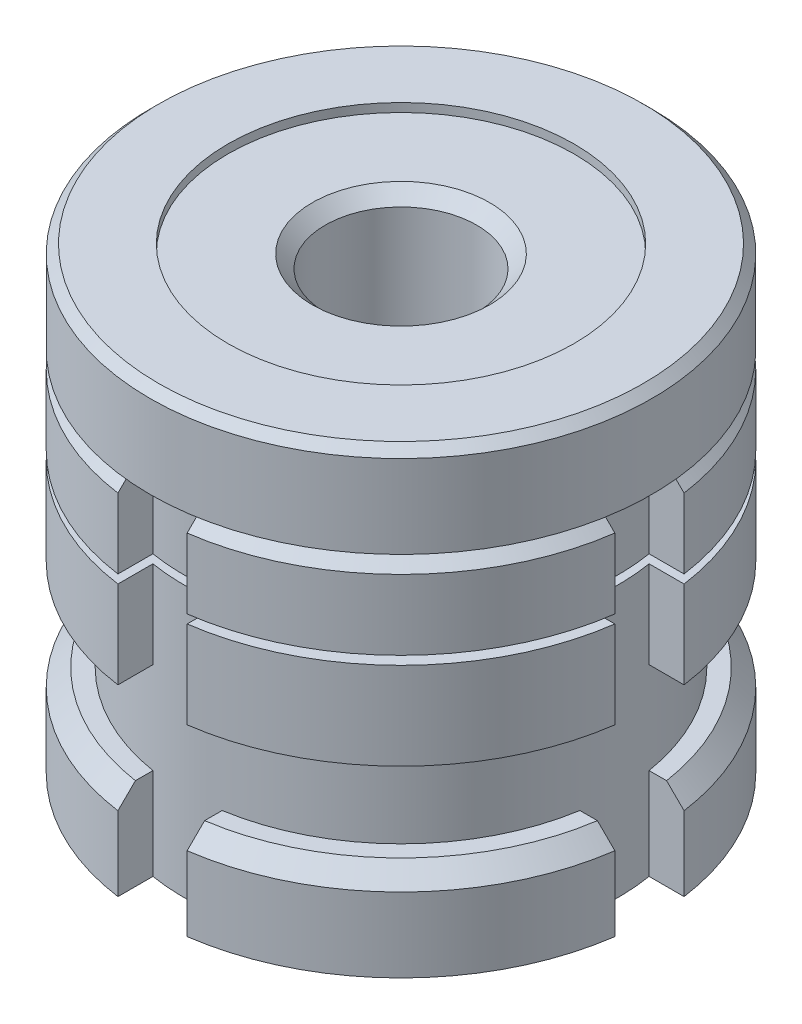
ISO-10303-21;
HEADER;
FILE_DESCRIPTION(('STEP AP214'),'2;1');
FILE_NAME('part.step','',(''),(''),'','','');
FILE_SCHEMA(('AUTOMOTIVE_DESIGN { 1 0 10303 214 1 1 1 1 }'));
ENDSEC;
DATA;
#1=APPLICATION_CONTEXT('core data for automotive mechanical design processes');
#2=APPLICATION_PROTOCOL_DEFINITION('international standard','automotive_design',2000,#1);
#3=PRODUCT_CONTEXT('',#1,'mechanical');
#4=PRODUCT('Part','Part','',(#3));
#5=PRODUCT_RELATED_PRODUCT_CATEGORY('part','',(#4));
#6=PRODUCT_DEFINITION_FORMATION('','',#4);
#7=PRODUCT_DEFINITION_CONTEXT('part definition',#1,'design');
#8=PRODUCT_DEFINITION('design','',#6,#7);
#9=PRODUCT_DEFINITION_SHAPE('','',#8);
#10=(LENGTH_UNIT() NAMED_UNIT(*) SI_UNIT(.MILLI.,.METRE.));
#11=(NAMED_UNIT(*) PLANE_ANGLE_UNIT() SI_UNIT($,.RADIAN.));
#12=(NAMED_UNIT(*) SI_UNIT($,.STERADIAN.) SOLID_ANGLE_UNIT());
#13=UNCERTAINTY_MEASURE_WITH_UNIT(LENGTH_MEASURE(1.E-05),#10,'distance_accuracy_value','');
#14=(GEOMETRIC_REPRESENTATION_CONTEXT(3) GLOBAL_UNCERTAINTY_ASSIGNED_CONTEXT((#13)) GLOBAL_UNIT_ASSIGNED_CONTEXT((#10,
#11,#12)) REPRESENTATION_CONTEXT('',''));
#15=CARTESIAN_POINT('',(0.,0.,0.));
#16=DIRECTION('',(0.,0.,1.));
#17=DIRECTION('',(1.,0.,0.));
#18=AXIS2_PLACEMENT_3D('',#15,#16,#17);
#19=CARTESIAN_POINT('',(0.,21.2,0.));
#20=DIRECTION('',(0.,-1.,0.));
#21=DIRECTION('',(0.,0.,-1.));
#22=AXIS2_PLACEMENT_3D('',#19,#20,#21);
#23=CYLINDRICAL_SURFACE('',#22,29.);
#24=DIRECTION('',(0.,1.,0.));
#25=VECTOR('',#24,1.);
#26=CARTESIAN_POINT('',(-3.9999999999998,-30.2928724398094,28.7228132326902));
#27=LINE('',#26,#25);
#28=CARTESIAN_POINT('',(-3.9999999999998,11.1,28.7228132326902));
#29=VERTEX_POINT('',#28);
#30=CARTESIAN_POINT('',(-3.9999999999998,19.2,28.7228132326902));
#31=VERTEX_POINT('',#30);
#32=EDGE_CURVE('E1111',#29,#31,#27,.T.);
#33=ORIENTED_EDGE('',*,*,#32,.T.);
#34=CARTESIAN_POINT('',(0.,19.2,0.));
#35=DIRECTION('',(0.,1.,0.));
#36=DIRECTION('',(0.,0.,1.));
#37=AXIS2_PLACEMENT_3D('',#34,#35,#36);
#38=CIRCLE('',#37,29.);
#39=CARTESIAN_POINT('',(-28.7228132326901,19.2,4.00000000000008));
#40=VERTEX_POINT('',#39);
#41=EDGE_CURVE('E55',#31,#40,#38,.F.);
#42=ORIENTED_EDGE('',*,*,#41,.T.);
#43=DIRECTION('',(0.,1.,0.));
#44=VECTOR('',#43,1.);
#45=CARTESIAN_POINT('',(-28.7228132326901,-30.2928724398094,4.00000000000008));
#46=LINE('',#45,#44);
#47=CARTESIAN_POINT('',(-28.7228132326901,11.1,4.00000000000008));
#48=VERTEX_POINT('',#47);
#49=EDGE_CURVE('E867',#48,#40,#46,.T.);
#50=ORIENTED_EDGE('',*,*,#49,.F.);
#51=CARTESIAN_POINT('',(0.,11.1,0.));
#52=DIRECTION('',(0.,1.,0.));
#53=DIRECTION('',(0.,0.,1.));
#54=AXIS2_PLACEMENT_3D('',#51,#52,#53);
#55=CIRCLE('',#54,29.);
#56=EDGE_CURVE('E590',#48,#29,#55,.T.);
#57=ORIENTED_EDGE('',*,*,#56,.T.);
#58=EDGE_LOOP('',(#33,#42,#50,#57));
#59=FACE_BOUND('',#58,.T.);
#60=ADVANCED_FACE('F39',(#59),#23,.T.);
#61=DIRECTION('',(0.,1.,0.));
#62=VECTOR('',#61,1.);
#63=CARTESIAN_POINT('',(-28.7228132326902,-30.2928724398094,-3.99999999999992));
#64=LINE('',#63,#62);
#65=CARTESIAN_POINT('',(-28.7228132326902,11.1,-3.99999999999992));
#66=VERTEX_POINT('',#65);
#67=CARTESIAN_POINT('',(-28.7228132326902,19.2,-3.99999999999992));
#68=VERTEX_POINT('',#67);
#69=EDGE_CURVE('E884',#66,#68,#64,.T.);
#70=ORIENTED_EDGE('',*,*,#69,.T.);
#71=CARTESIAN_POINT('',(0.,19.2,0.));
#72=DIRECTION('',(0.,1.,0.));
#73=DIRECTION('',(0.,0.,1.));
#74=AXIS2_PLACEMENT_3D('',#71,#72,#73);
#75=CIRCLE('',#74,29.);
#76=CARTESIAN_POINT('',(-3.9999999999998,19.2,-28.7228132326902));
#77=VERTEX_POINT('',#76);
#78=EDGE_CURVE('E648',#68,#77,#75,.F.);
#79=ORIENTED_EDGE('',*,*,#78,.T.);
#80=DIRECTION('',(0.,1.,0.));
#81=VECTOR('',#80,1.);
#82=CARTESIAN_POINT('',(-3.9999999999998,-30.2928724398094,-28.7228132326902));
#83=LINE('',#82,#81);
#84=CARTESIAN_POINT('',(-3.9999999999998,11.1,-28.7228132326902));
#85=VERTEX_POINT('',#84);
#86=EDGE_CURVE('E463',#85,#77,#83,.T.);
#87=ORIENTED_EDGE('',*,*,#86,.F.);
#88=EDGE_CURVE('E1224',#85,#66,#55,.T.);
#89=ORIENTED_EDGE('',*,*,#88,.T.);
#90=EDGE_LOOP('',(#70,#79,#87,#89));
#91=FACE_BOUND('',#90,.T.);
#92=ADVANCED_FACE('F1241',(#91),#23,.T.);
#93=DIRECTION('',(0.,1.,0.));
#94=VECTOR('',#93,1.);
#95=CARTESIAN_POINT('',(28.7228132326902,-30.2928724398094,3.99999999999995));
#96=LINE('',#95,#94);
#97=CARTESIAN_POINT('',(28.7228132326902,11.1,3.99999999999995));
#98=VERTEX_POINT('',#97);
#99=CARTESIAN_POINT('',(28.7228132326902,19.2,3.99999999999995));
#100=VERTEX_POINT('',#99);
#101=EDGE_CURVE('E1019',#98,#100,#96,.T.);
#102=ORIENTED_EDGE('',*,*,#101,.T.);
#103=CARTESIAN_POINT('',(0.,19.2,0.));
#104=DIRECTION('',(0.,1.,0.));
#105=DIRECTION('',(0.,0.,1.));
#106=AXIS2_PLACEMENT_3D('',#103,#104,#105);
#107=CIRCLE('',#106,29.);
#108=CARTESIAN_POINT('',(3.99999999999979,19.2,28.7228132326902));
#109=VERTEX_POINT('',#108);
#110=EDGE_CURVE('E730',#100,#109,#107,.F.);
#111=ORIENTED_EDGE('',*,*,#110,.T.);
#112=DIRECTION('',(0.,1.,0.));
#113=VECTOR('',#112,1.);
#114=CARTESIAN_POINT('',(3.99999999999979,-30.2928724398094,28.7228132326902));
#115=LINE('',#114,#113);
#116=CARTESIAN_POINT('',(3.99999999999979,11.1,28.7228132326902));
#117=VERTEX_POINT('',#116);
#118=EDGE_CURVE('E1102',#117,#109,#115,.T.);
#119=ORIENTED_EDGE('',*,*,#118,.F.);
#120=EDGE_CURVE('E591',#117,#98,#55,.T.);
#121=ORIENTED_EDGE('',*,*,#120,.T.);
#122=EDGE_LOOP('',(#102,#111,#119,#121));
#123=FACE_BOUND('',#122,.T.);
#124=ADVANCED_FACE('F1100',(#123),#23,.T.);
#125=CARTESIAN_POINT('',(0.,11.1,29.));
#126=DIRECTION('',(0.,1.,0.));
#127=DIRECTION('',(0.,0.,1.));
#128=AXIS2_PLACEMENT_3D('',#125,#126,#127);
#129=PLANE('',#128);
#130=CARTESIAN_POINT('',(0.,11.1,0.));
#131=DIRECTION('',(0.,1.,0.));
#132=DIRECTION('',(0.,0.,1.));
#133=AXIS2_PLACEMENT_3D('',#130,#131,#132);
#134=CIRCLE('',#133,20.);
#135=CARTESIAN_POINT('',(0.,11.1,20.));
#136=VERTEX_POINT('',#135);
#137=EDGE_CURVE('E595',#136,#136,#134,.T.);
#138=ORIENTED_EDGE('',*,*,#137,.T.);
#139=EDGE_LOOP('',(#138));
#140=FACE_BOUND('',#139,.T.);
#141=ORIENTED_EDGE('',*,*,#56,.F.);
#142=DIRECTION('',(1.,0.,0.));
#143=VECTOR('',#142,1.);
#144=CARTESIAN_POINT('',(0.,11.1,4.00000000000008));
#145=LINE('',#144,#143);
#146=CARTESIAN_POINT('',(-24.6779253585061,11.1,4.00000000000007));
#147=VERTEX_POINT('',#146);
#148=EDGE_CURVE('E565',#48,#147,#145,.T.);
#149=ORIENTED_EDGE('',*,*,#148,.T.);
#150=CARTESIAN_POINT('',(0.,11.1,0.));
#151=DIRECTION('',(0.,1.,0.));
#152=DIRECTION('',(0.,0.,1.));
#153=AXIS2_PLACEMENT_3D('',#150,#151,#152);
#154=CIRCLE('',#153,25.);
#155=CARTESIAN_POINT('',(-24.6779253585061,11.1,-3.99999999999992));
#156=VERTEX_POINT('',#155);
#157=EDGE_CURVE('E549',#147,#156,#154,.F.);
#158=ORIENTED_EDGE('',*,*,#157,.T.);
#159=DIRECTION('',(-1.,0.,0.));
#160=VECTOR('',#159,1.);
#161=CARTESIAN_POINT('',(0.,11.1,-3.99999999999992));
#162=LINE('',#161,#160);
#163=EDGE_CURVE('E542',#156,#66,#162,.T.);
#164=ORIENTED_EDGE('',*,*,#163,.T.);
#165=ORIENTED_EDGE('',*,*,#88,.F.);
#166=DIRECTION('',(0.,0.,1.));
#167=VECTOR('',#166,1.);
#168=CARTESIAN_POINT('',(-3.9999999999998,11.1,29.));
#169=LINE('',#168,#167);
#170=CARTESIAN_POINT('',(-3.9999999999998,11.1,-24.6779253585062));
#171=VERTEX_POINT('',#170);
#172=EDGE_CURVE('E528',#85,#171,#169,.T.);
#173=ORIENTED_EDGE('',*,*,#172,.T.);
#174=CARTESIAN_POINT('',(0.,11.1,0.));
#175=DIRECTION('',(0.,1.,0.));
#176=DIRECTION('',(0.,0.,1.));
#177=AXIS2_PLACEMENT_3D('',#174,#175,#176);
#178=CIRCLE('',#177,25.);
#179=CARTESIAN_POINT('',(3.99999999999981,11.1,-24.6779253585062));
#180=VERTEX_POINT('',#179);
#181=EDGE_CURVE('E422',#171,#180,#178,.F.);
#182=ORIENTED_EDGE('',*,*,#181,.T.);
#183=DIRECTION('',(0.,0.,-1.));
#184=VECTOR('',#183,1.);
#185=CARTESIAN_POINT('',(3.9999999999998,11.1,29.));
#186=LINE('',#185,#184);
#187=CARTESIAN_POINT('',(3.9999999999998,11.1,-28.7228132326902));
#188=VERTEX_POINT('',#187);
#189=EDGE_CURVE('E501',#180,#188,#186,.T.);
#190=ORIENTED_EDGE('',*,*,#189,.T.);
#191=CARTESIAN_POINT('',(28.7228132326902,11.1,-3.99999999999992));
#192=VERTEX_POINT('',#191);
#193=EDGE_CURVE('E596',#192,#188,#55,.T.);
#194=ORIENTED_EDGE('',*,*,#193,.F.);
#195=DIRECTION('',(-1.,0.,0.));
#196=VECTOR('',#195,1.);
#197=CARTESIAN_POINT('',(0.,11.1,-3.99999999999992));
#198=LINE('',#197,#196);
#199=CARTESIAN_POINT('',(24.6779253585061,11.1,-3.99999999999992));
#200=VERTEX_POINT('',#199);
#201=EDGE_CURVE('E1067',#192,#200,#198,.T.);
#202=ORIENTED_EDGE('',*,*,#201,.T.);
#203=CARTESIAN_POINT('',(0.,11.1,0.));
#204=DIRECTION('',(0.,1.,0.));
#205=DIRECTION('',(0.,0.,1.));
#206=AXIS2_PLACEMENT_3D('',#203,#204,#205);
#207=CIRCLE('',#206,25.);
#208=CARTESIAN_POINT('',(24.6779253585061,11.1,3.99999999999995));
#209=VERTEX_POINT('',#208);
#210=EDGE_CURVE('E1065',#200,#209,#207,.F.);
#211=ORIENTED_EDGE('',*,*,#210,.T.);
#212=DIRECTION('',(1.,0.,0.));
#213=VECTOR('',#212,1.);
#214=CARTESIAN_POINT('',(0.,11.1,3.99999999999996));
#215=LINE('',#214,#213);
#216=EDGE_CURVE('E989',#209,#98,#215,.T.);
#217=ORIENTED_EDGE('',*,*,#216,.T.);
#218=ORIENTED_EDGE('',*,*,#120,.F.);
#219=DIRECTION('',(0.,0.,-1.));
#220=VECTOR('',#219,1.);
#221=CARTESIAN_POINT('',(3.9999999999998,11.1,29.));
#222=LINE('',#221,#220);
#223=CARTESIAN_POINT('',(3.9999999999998,11.1,24.6779253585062));
#224=VERTEX_POINT('',#223);
#225=EDGE_CURVE('E848',#117,#224,#222,.T.);
#226=ORIENTED_EDGE('',*,*,#225,.T.);
#227=CARTESIAN_POINT('',(0.,11.1,0.));
#228=DIRECTION('',(0.,1.,0.));
#229=DIRECTION('',(0.,0.,1.));
#230=AXIS2_PLACEMENT_3D('',#227,#228,#229);
#231=CIRCLE('',#230,25.);
#232=CARTESIAN_POINT('',(-3.9999999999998,11.1,24.6779253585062));
#233=VERTEX_POINT('',#232);
#234=EDGE_CURVE('E871',#224,#233,#231,.F.);
#235=ORIENTED_EDGE('',*,*,#234,.T.);
#236=DIRECTION('',(0.,0.,1.));
#237=VECTOR('',#236,1.);
#238=CARTESIAN_POINT('',(-3.9999999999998,11.1,29.));
#239=LINE('',#238,#237);
#240=EDGE_CURVE('E1157',#233,#29,#239,.T.);
#241=ORIENTED_EDGE('',*,*,#240,.T.);
#242=EDGE_LOOP('',(#141,#149,#158,#164,#165,#173,#182,#190,#194,#202,#211,#217,#218,#226,#235,#241));
#243=FACE_BOUND('',#242,.T.);
#244=ADVANCED_FACE('F1071',(#140,#243),#129,.F.);
#245=CARTESIAN_POINT('',(0.,10.1,29.));
#246=DIRECTION('',(0.,-1.,0.));
#247=DIRECTION('',(0.,0.,-1.));
#248=AXIS2_PLACEMENT_3D('',#245,#246,#247);
#249=PLANE('',#248);
#250=CARTESIAN_POINT('',(0.,10.1,0.));
#251=DIRECTION('',(0.,1.,0.));
#252=DIRECTION('',(0.,0.,1.));
#253=AXIS2_PLACEMENT_3D('',#250,#251,#252);
#254=CIRCLE('',#253,20.);
#255=CARTESIAN_POINT('',(0.,10.1,20.));
#256=VERTEX_POINT('',#255);
#257=EDGE_CURVE('E574',#256,#256,#254,.T.);
#258=ORIENTED_EDGE('',*,*,#257,.F.);
#259=EDGE_LOOP('',(#258));
#260=FACE_BOUND('',#259,.T.);
#261=CARTESIAN_POINT('',(0.,10.1,0.));
#262=DIRECTION('',(0.,-1.,0.));
#263=DIRECTION('',(0.,0.,-1.));
#264=AXIS2_PLACEMENT_3D('',#261,#262,#263);
#265=CIRCLE('',#264,25.);
#266=CARTESIAN_POINT('',(-24.6779253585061,10.1,-3.99999999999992));
#267=VERTEX_POINT('',#266);
#268=CARTESIAN_POINT('',(-24.6779253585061,10.1,4.00000000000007));
#269=VERTEX_POINT('',#268);
#270=EDGE_CURVE('E546',#267,#269,#265,.F.);
#271=ORIENTED_EDGE('',*,*,#270,.T.);
#272=DIRECTION('',(-1.,0.,0.));
#273=VECTOR('',#272,1.);
#274=CARTESIAN_POINT('',(0.,10.1,4.00000000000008));
#275=LINE('',#274,#273);
#276=CARTESIAN_POINT('',(-28.7228132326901,10.1,4.00000000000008));
#277=VERTEX_POINT('',#276);
#278=EDGE_CURVE('E561',#269,#277,#275,.T.);
#279=ORIENTED_EDGE('',*,*,#278,.T.);
#280=CARTESIAN_POINT('',(0.,10.1,0.));
#281=DIRECTION('',(0.,1.,0.));
#282=DIRECTION('',(0.,0.,1.));
#283=AXIS2_PLACEMENT_3D('',#280,#281,#282);
#284=CIRCLE('',#283,29.);
#285=CARTESIAN_POINT('',(-3.9999999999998,10.1,28.7228132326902));
#286=VERTEX_POINT('',#285);
#287=EDGE_CURVE('E585',#277,#286,#284,.T.);
#288=ORIENTED_EDGE('',*,*,#287,.T.);
#289=DIRECTION('',(0.,0.,-1.));
#290=VECTOR('',#289,1.);
#291=CARTESIAN_POINT('',(-3.9999999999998,10.1,29.));
#292=LINE('',#291,#290);
#293=CARTESIAN_POINT('',(-3.9999999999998,10.1,24.6779253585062));
#294=VERTEX_POINT('',#293);
#295=EDGE_CURVE('E1153',#286,#294,#292,.T.);
#296=ORIENTED_EDGE('',*,*,#295,.T.);
#297=CARTESIAN_POINT('',(0.,10.1,0.));
#298=DIRECTION('',(0.,-1.,0.));
#299=DIRECTION('',(0.,0.,-1.));
#300=AXIS2_PLACEMENT_3D('',#297,#298,#299);
#301=CIRCLE('',#300,25.);
#302=CARTESIAN_POINT('',(3.9999999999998,10.1,24.6779253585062));
#303=VERTEX_POINT('',#302);
#304=EDGE_CURVE('E864',#294,#303,#301,.F.);
#305=ORIENTED_EDGE('',*,*,#304,.T.);
#306=DIRECTION('',(0.,0.,1.));
#307=VECTOR('',#306,1.);
#308=CARTESIAN_POINT('',(3.9999999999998,10.1,29.));
#309=LINE('',#308,#307);
#310=CARTESIAN_POINT('',(3.99999999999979,10.1,28.7228132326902));
#311=VERTEX_POINT('',#310);
#312=EDGE_CURVE('E1150',#303,#311,#309,.T.);
#313=ORIENTED_EDGE('',*,*,#312,.T.);
#314=CARTESIAN_POINT('',(28.7228132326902,10.1,3.99999999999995));
#315=VERTEX_POINT('',#314);
#316=EDGE_CURVE('E586',#311,#315,#284,.T.);
#317=ORIENTED_EDGE('',*,*,#316,.T.);
#318=DIRECTION('',(-1.,0.,0.));
#319=VECTOR('',#318,1.);
#320=CARTESIAN_POINT('',(0.,10.1,3.99999999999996));
#321=LINE('',#320,#319);
#322=CARTESIAN_POINT('',(24.6779253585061,10.1,3.99999999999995));
#323=VERTEX_POINT('',#322);
#324=EDGE_CURVE('E1088',#315,#323,#321,.T.);
#325=ORIENTED_EDGE('',*,*,#324,.T.);
#326=CARTESIAN_POINT('',(0.,10.1,0.));
#327=DIRECTION('',(0.,-1.,0.));
#328=DIRECTION('',(0.,0.,-1.));
#329=AXIS2_PLACEMENT_3D('',#326,#327,#328);
#330=CIRCLE('',#329,25.);
#331=CARTESIAN_POINT('',(24.6779253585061,10.1,-3.99999999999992));
#332=VERTEX_POINT('',#331);
#333=EDGE_CURVE('E1161',#323,#332,#330,.F.);
#334=ORIENTED_EDGE('',*,*,#333,.T.);
#335=DIRECTION('',(1.,0.,0.));
#336=VECTOR('',#335,1.);
#337=CARTESIAN_POINT('',(0.,10.1,-3.99999999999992));
#338=LINE('',#337,#336);
#339=CARTESIAN_POINT('',(28.7228132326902,10.1,-3.99999999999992));
#340=VERTEX_POINT('',#339);
#341=EDGE_CURVE('E1076',#332,#340,#338,.T.);
#342=ORIENTED_EDGE('',*,*,#341,.T.);
#343=CARTESIAN_POINT('',(3.9999999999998,10.1,-28.7228132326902));
#344=VERTEX_POINT('',#343);
#345=EDGE_CURVE('E499',#340,#344,#284,.T.);
#346=ORIENTED_EDGE('',*,*,#345,.T.);
#347=DIRECTION('',(0.,0.,1.));
#348=VECTOR('',#347,1.);
#349=CARTESIAN_POINT('',(3.9999999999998,10.1,29.));
#350=LINE('',#349,#348);
#351=CARTESIAN_POINT('',(3.99999999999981,10.1,-24.6779253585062));
#352=VERTEX_POINT('',#351);
#353=EDGE_CURVE('E483',#344,#352,#350,.T.);
#354=ORIENTED_EDGE('',*,*,#353,.T.);
#355=CARTESIAN_POINT('',(0.,10.1,0.));
#356=DIRECTION('',(0.,-1.,0.));
#357=DIRECTION('',(0.,0.,-1.));
#358=AXIS2_PLACEMENT_3D('',#355,#356,#357);
#359=CIRCLE('',#358,25.);
#360=CARTESIAN_POINT('',(-3.9999999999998,10.1,-24.6779253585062));
#361=VERTEX_POINT('',#360);
#362=EDGE_CURVE('E496',#352,#361,#359,.F.);
#363=ORIENTED_EDGE('',*,*,#362,.T.);
#364=DIRECTION('',(0.,0.,-1.));
#365=VECTOR('',#364,1.);
#366=CARTESIAN_POINT('',(-3.9999999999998,10.1,29.));
#367=LINE('',#366,#365);
#368=CARTESIAN_POINT('',(-3.9999999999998,10.1,-28.7228132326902));
#369=VERTEX_POINT('',#368);
#370=EDGE_CURVE('E525',#361,#369,#367,.T.);
#371=ORIENTED_EDGE('',*,*,#370,.T.);
#372=CARTESIAN_POINT('',(-28.7228132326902,10.1,-3.99999999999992));
#373=VERTEX_POINT('',#372);
#374=EDGE_CURVE('E1332',#369,#373,#284,.T.);
#375=ORIENTED_EDGE('',*,*,#374,.T.);
#376=DIRECTION('',(1.,0.,0.));
#377=VECTOR('',#376,1.);
#378=CARTESIAN_POINT('',(0.,10.1,-3.99999999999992));
#379=LINE('',#378,#377);
#380=EDGE_CURVE('E538',#373,#267,#379,.T.);
#381=ORIENTED_EDGE('',*,*,#380,.T.);
#382=EDGE_LOOP('',(#271,#279,#288,#296,#305,#313,#317,#325,#334,#342,#346,#354,#363,#371,#375,#381));
#383=FACE_BOUND('',#382,.T.);
#384=ADVANCED_FACE('F494',(#260,#383),#249,.F.);
#385=CARTESIAN_POINT('',(0.,0.,0.));
#386=DIRECTION('',(0.,1.,0.));
#387=DIRECTION('',(0.,0.,1.));
#388=AXIS2_PLACEMENT_3D('',#385,#386,#387);
#389=PLANE('',#388);
#390=CARTESIAN_POINT('',(0.,0.,0.));
#391=DIRECTION('',(0.,1.,0.));
#392=DIRECTION('',(0.,0.,1.));
#393=AXIS2_PLACEMENT_3D('',#390,#391,#392);
#394=CIRCLE('',#393,29.);
#395=CARTESIAN_POINT('',(-28.7228132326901,0.,4.00000000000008));
#396=VERTEX_POINT('',#395);
#397=CARTESIAN_POINT('',(-3.9999999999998,0.,28.7228132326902));
#398=VERTEX_POINT('',#397);
#399=EDGE_CURVE('E600',#396,#398,#394,.T.);
#400=ORIENTED_EDGE('',*,*,#399,.F.);
#401=DIRECTION('',(1.,0.,0.));
#402=VECTOR('',#401,1.);
#403=CARTESIAN_POINT('',(0.,0.,4.00000000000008));
#404=LINE('',#403,#402);
#405=CARTESIAN_POINT('',(-24.6779253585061,0.,4.00000000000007));
#406=VERTEX_POINT('',#405);
#407=EDGE_CURVE('E557',#396,#406,#404,.T.);
#408=ORIENTED_EDGE('',*,*,#407,.T.);
#409=CARTESIAN_POINT('',(0.,0.,0.));
#410=DIRECTION('',(0.,-1.,0.));
#411=DIRECTION('',(0.,0.,-1.));
#412=AXIS2_PLACEMENT_3D('',#409,#410,#411);
#413=CIRCLE('',#412,25.);
#414=CARTESIAN_POINT('',(-3.9999999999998,0.,24.6779253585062));
#415=VERTEX_POINT('',#414);
#416=EDGE_CURVE('E1294',#415,#406,#413,.T.);
#417=ORIENTED_EDGE('',*,*,#416,.F.);
#418=DIRECTION('',(0.,0.,1.));
#419=VECTOR('',#418,1.);
#420=CARTESIAN_POINT('',(-3.9999999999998,0.,0.));
#421=LINE('',#420,#419);
#422=EDGE_CURVE('E847',#415,#398,#421,.T.);
#423=ORIENTED_EDGE('',*,*,#422,.T.);
#424=EDGE_LOOP('',(#400,#408,#417,#423));
#425=FACE_BOUND('',#424,.T.);
#426=ADVANCED_FACE('F1256',(#425),#389,.F.);
#427=CARTESIAN_POINT('',(-24.6779253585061,0.,-3.99999999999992));
#428=VERTEX_POINT('',#427);
#429=CARTESIAN_POINT('',(-3.9999999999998,0.,-24.6779253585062));
#430=VERTEX_POINT('',#429);
#431=EDGE_CURVE('E581',#428,#430,#413,.T.);
#432=ORIENTED_EDGE('',*,*,#431,.F.);
#433=DIRECTION('',(-1.,0.,0.));
#434=VECTOR('',#433,1.);
#435=CARTESIAN_POINT('',(0.,0.,-3.99999999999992));
#436=LINE('',#435,#434);
#437=CARTESIAN_POINT('',(-28.7228132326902,0.,-3.99999999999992));
#438=VERTEX_POINT('',#437);
#439=EDGE_CURVE('E534',#428,#438,#436,.T.);
#440=ORIENTED_EDGE('',*,*,#439,.T.);
#441=CARTESIAN_POINT('',(-3.9999999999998,0.,-28.7228132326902));
#442=VERTEX_POINT('',#441);
#443=EDGE_CURVE('E1282',#442,#438,#394,.T.);
#444=ORIENTED_EDGE('',*,*,#443,.F.);
#445=DIRECTION('',(0.,0.,1.));
#446=VECTOR('',#445,1.);
#447=CARTESIAN_POINT('',(-3.9999999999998,0.,0.));
#448=LINE('',#447,#446);
#449=EDGE_CURVE('E521',#442,#430,#448,.T.);
#450=ORIENTED_EDGE('',*,*,#449,.T.);
#451=EDGE_LOOP('',(#432,#440,#444,#450));
#452=FACE_BOUND('',#451,.T.);
#453=ADVANCED_FACE('F1721',(#452),#389,.F.);
#454=CARTESIAN_POINT('',(24.6779253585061,0.,3.99999999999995));
#455=VERTEX_POINT('',#454);
#456=CARTESIAN_POINT('',(3.9999999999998,0.,24.6779253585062));
#457=VERTEX_POINT('',#456);
#458=EDGE_CURVE('E580',#455,#457,#413,.T.);
#459=ORIENTED_EDGE('',*,*,#458,.F.);
#460=DIRECTION('',(1.,0.,0.));
#461=VECTOR('',#460,1.);
#462=CARTESIAN_POINT('',(0.,0.,3.99999999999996));
#463=LINE('',#462,#461);
#464=CARTESIAN_POINT('',(28.7228132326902,0.,3.99999999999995));
#465=VERTEX_POINT('',#464);
#466=EDGE_CURVE('E1079',#455,#465,#463,.T.);
#467=ORIENTED_EDGE('',*,*,#466,.T.);
#468=CARTESIAN_POINT('',(3.9999999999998,0.,28.7228132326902));
#469=VERTEX_POINT('',#468);
#470=EDGE_CURVE('E601',#469,#465,#394,.T.);
#471=ORIENTED_EDGE('',*,*,#470,.F.);
#472=DIRECTION('',(0.,0.,-1.));
#473=VECTOR('',#472,1.);
#474=CARTESIAN_POINT('',(3.9999999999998,0.,0.));
#475=LINE('',#474,#473);
#476=EDGE_CURVE('E1187',#469,#457,#475,.T.);
#477=ORIENTED_EDGE('',*,*,#476,.T.);
#478=EDGE_LOOP('',(#459,#467,#471,#477));
#479=FACE_BOUND('',#478,.T.);
#480=ADVANCED_FACE('F1186',(#479),#389,.F.);
#481=ORIENTED_EDGE('',*,*,#287,.F.);
#482=EDGE_CURVE('E865',#396,#277,#46,.T.);
#483=ORIENTED_EDGE('',*,*,#482,.F.);
#484=ORIENTED_EDGE('',*,*,#399,.T.);
#485=EDGE_CURVE('E1109',#398,#286,#27,.T.);
#486=ORIENTED_EDGE('',*,*,#485,.T.);
#487=EDGE_LOOP('',(#481,#483,#484,#486));
#488=FACE_BOUND('',#487,.T.);
#489=ADVANCED_FACE('F1273',(#488),#23,.T.);
#490=ORIENTED_EDGE('',*,*,#443,.T.);
#491=EDGE_CURVE('E882',#438,#373,#64,.T.);
#492=ORIENTED_EDGE('',*,*,#491,.T.);
#493=ORIENTED_EDGE('',*,*,#374,.F.);
#494=EDGE_CURVE('E952',#442,#369,#83,.T.);
#495=ORIENTED_EDGE('',*,*,#494,.F.);
#496=EDGE_LOOP('',(#490,#492,#493,#495));
#497=FACE_BOUND('',#496,.T.);
#498=ADVANCED_FACE('F1267',(#497),#23,.T.);
#499=ORIENTED_EDGE('',*,*,#470,.T.);
#500=EDGE_CURVE('E1018',#465,#315,#96,.T.);
#501=ORIENTED_EDGE('',*,*,#500,.T.);
#502=ORIENTED_EDGE('',*,*,#316,.F.);
#503=EDGE_CURVE('E1105',#469,#311,#115,.T.);
#504=ORIENTED_EDGE('',*,*,#503,.F.);
#505=EDGE_LOOP('',(#499,#501,#502,#504));
#506=FACE_BOUND('',#505,.T.);
#507=ADVANCED_FACE('F1182',(#506),#23,.T.);
#508=CARTESIAN_POINT('',(0.,-10.6,0.));
#509=DIRECTION('',(0.,-1.,0.));
#510=DIRECTION('',(0.,0.,-1.));
#511=AXIS2_PLACEMENT_3D('',#508,#509,#510);
#512=CYLINDRICAL_SURFACE('',#511,29.);
#513=CARTESIAN_POINT('',(-3.9999999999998,-21.2,28.7228132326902));
#514=VERTEX_POINT('',#513);
#515=CARTESIAN_POINT('',(-3.9999999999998,-12.6,28.7228132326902));
#516=VERTEX_POINT('',#515);
#517=EDGE_CURVE('E858',#514,#516,#27,.T.);
#518=ORIENTED_EDGE('',*,*,#517,.T.);
#519=CARTESIAN_POINT('',(0.,-12.6,0.));
#520=DIRECTION('',(0.,-1.,0.));
#521=DIRECTION('',(0.,0.,-1.));
#522=AXIS2_PLACEMENT_3D('',#519,#520,#521);
#523=CIRCLE('',#522,29.);
#524=CARTESIAN_POINT('',(-28.7228132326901,-12.6,4.00000000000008));
#525=VERTEX_POINT('',#524);
#526=EDGE_CURVE('E776',#516,#525,#523,.T.);
#527=ORIENTED_EDGE('',*,*,#526,.T.);
#528=CARTESIAN_POINT('',(-28.7228132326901,-21.2,4.00000000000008));
#529=VERTEX_POINT('',#528);
#530=EDGE_CURVE('E856',#529,#525,#46,.T.);
#531=ORIENTED_EDGE('',*,*,#530,.F.);
#532=CARTESIAN_POINT('',(0.,-21.2,0.));
#533=DIRECTION('',(0.,-1.,0.));
#534=DIRECTION('',(0.,0.,-1.));
#535=AXIS2_PLACEMENT_3D('',#532,#533,#534);
#536=CIRCLE('',#535,29.);
#537=EDGE_CURVE('E1305',#514,#529,#536,.T.);
#538=ORIENTED_EDGE('',*,*,#537,.F.);
#539=EDGE_LOOP('',(#518,#527,#531,#538));
#540=FACE_BOUND('',#539,.T.);
#541=ADVANCED_FACE('F854',(#540),#512,.T.);
#542=CARTESIAN_POINT('',(-28.7228132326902,-21.2,-3.99999999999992));
#543=VERTEX_POINT('',#542);
#544=CARTESIAN_POINT('',(-28.7228132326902,-12.6,-3.99999999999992));
#545=VERTEX_POINT('',#544);
#546=EDGE_CURVE('E877',#543,#545,#64,.T.);
#547=ORIENTED_EDGE('',*,*,#546,.T.);
#548=CARTESIAN_POINT('',(0.,-12.6,0.));
#549=DIRECTION('',(0.,-1.,0.));
#550=DIRECTION('',(0.,0.,-1.));
#551=AXIS2_PLACEMENT_3D('',#548,#549,#550);
#552=CIRCLE('',#551,29.);
#553=CARTESIAN_POINT('',(-3.9999999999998,-12.6,-28.7228132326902));
#554=VERTEX_POINT('',#553);
#555=EDGE_CURVE('E610',#545,#554,#552,.T.);
#556=ORIENTED_EDGE('',*,*,#555,.T.);
#557=CARTESIAN_POINT('',(-3.9999999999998,-21.2,-28.7228132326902));
#558=VERTEX_POINT('',#557);
#559=EDGE_CURVE('E948',#558,#554,#83,.T.);
#560=ORIENTED_EDGE('',*,*,#559,.F.);
#561=EDGE_CURVE('E569',#543,#558,#536,.T.);
#562=ORIENTED_EDGE('',*,*,#561,.F.);
#563=EDGE_LOOP('',(#547,#556,#560,#562));
#564=FACE_BOUND('',#563,.T.);
#565=ADVANCED_FACE('F1272',(#564),#512,.T.);
#566=CARTESIAN_POINT('',(28.7228132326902,-21.2,3.99999999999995));
#567=VERTEX_POINT('',#566);
#568=CARTESIAN_POINT('',(28.7228132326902,-12.6,3.99999999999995));
#569=VERTEX_POINT('',#568);
#570=EDGE_CURVE('E1012',#567,#569,#96,.T.);
#571=ORIENTED_EDGE('',*,*,#570,.T.);
#572=CARTESIAN_POINT('',(0.,-12.6,0.));
#573=DIRECTION('',(0.,-1.,0.));
#574=DIRECTION('',(0.,0.,-1.));
#575=AXIS2_PLACEMENT_3D('',#572,#573,#574);
#576=CIRCLE('',#575,29.);
#577=CARTESIAN_POINT('',(3.99999999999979,-12.6,28.7228132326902));
#578=VERTEX_POINT('',#577);
#579=EDGE_CURVE('E749',#569,#578,#576,.T.);
#580=ORIENTED_EDGE('',*,*,#579,.T.);
#581=CARTESIAN_POINT('',(3.99999999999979,-21.2,28.7228132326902));
#582=VERTEX_POINT('',#581);
#583=EDGE_CURVE('E1107',#582,#578,#115,.T.);
#584=ORIENTED_EDGE('',*,*,#583,.F.);
#585=EDGE_CURVE('E575',#567,#582,#536,.T.);
#586=ORIENTED_EDGE('',*,*,#585,.F.);
#587=EDGE_LOOP('',(#571,#580,#584,#586));
#588=FACE_BOUND('',#587,.T.);
#589=ADVANCED_FACE('F1254',(#588),#512,.T.);
#590=CARTESIAN_POINT('',(0.,-10.6,0.));
#591=DIRECTION('',(0.,-1.,0.));
#592=DIRECTION('',(0.,0.,-1.));
#593=AXIS2_PLACEMENT_3D('',#590,#591,#592);
#594=PLANE('',#593);
#595=DIRECTION('',(-1.,0.,0.));
#596=VECTOR('',#595,1.);
#597=CARTESIAN_POINT('',(0.,-10.6,4.00000000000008));
#598=LINE('',#597,#596);
#599=CARTESIAN_POINT('',(-24.6779253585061,-10.6,4.00000000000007));
#600=VERTEX_POINT('',#599);
#601=CARTESIAN_POINT('',(-26.7020598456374,-10.6,4.00000000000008));
#602=VERTEX_POINT('',#601);
#603=EDGE_CURVE('E553',#600,#602,#598,.T.);
#604=ORIENTED_EDGE('',*,*,#603,.T.);
#605=CARTESIAN_POINT('',(0.,-10.6,0.));
#606=DIRECTION('',(0.,-1.,0.));
#607=DIRECTION('',(0.,0.,-1.));
#608=AXIS2_PLACEMENT_3D('',#605,#606,#607);
#609=CIRCLE('',#608,27.);
#610=CARTESIAN_POINT('',(-3.9999999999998,-10.6,26.7020598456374));
#611=VERTEX_POINT('',#610);
#612=EDGE_CURVE('E786',#602,#611,#609,.F.);
#613=ORIENTED_EDGE('',*,*,#612,.T.);
#614=DIRECTION('',(0.,0.,-1.));
#615=VECTOR('',#614,1.);
#616=CARTESIAN_POINT('',(-3.9999999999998,-10.6,0.));
#617=LINE('',#616,#615);
#618=CARTESIAN_POINT('',(-3.9999999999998,-10.6,24.6779253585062));
#619=VERTEX_POINT('',#618);
#620=EDGE_CURVE('E840',#611,#619,#617,.T.);
#621=ORIENTED_EDGE('',*,*,#620,.T.);
#622=CARTESIAN_POINT('',(0.,-10.6,0.));
#623=DIRECTION('',(0.,-1.,0.));
#624=DIRECTION('',(0.,0.,-1.));
#625=AXIS2_PLACEMENT_3D('',#622,#623,#624);
#626=CIRCLE('',#625,25.);
#627=EDGE_CURVE('E1297',#619,#600,#626,.T.);
#628=ORIENTED_EDGE('',*,*,#627,.T.);
#629=EDGE_LOOP('',(#604,#613,#621,#628));
#630=FACE_BOUND('',#629,.T.);
#631=ADVANCED_FACE('F838',(#630),#594,.F.);
#632=DIRECTION('',(0.,0.,-1.));
#633=VECTOR('',#632,1.);
#634=CARTESIAN_POINT('',(-3.9999999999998,-10.6,0.));
#635=LINE('',#634,#633);
#636=CARTESIAN_POINT('',(-3.9999999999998,-10.6,-24.6779253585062));
#637=VERTEX_POINT('',#636);
#638=CARTESIAN_POINT('',(-3.9999999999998,-10.6,-26.7020598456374));
#639=VERTEX_POINT('',#638);
#640=EDGE_CURVE('E517',#637,#639,#635,.T.);
#641=ORIENTED_EDGE('',*,*,#640,.T.);
#642=CARTESIAN_POINT('',(0.,-10.6,0.));
#643=DIRECTION('',(0.,-1.,0.));
#644=DIRECTION('',(0.,0.,-1.));
#645=AXIS2_PLACEMENT_3D('',#642,#643,#644);
#646=CIRCLE('',#645,27.);
#647=CARTESIAN_POINT('',(-26.7020598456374,-10.6,-3.99999999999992));
#648=VERTEX_POINT('',#647);
#649=EDGE_CURVE('E623',#639,#648,#646,.F.);
#650=ORIENTED_EDGE('',*,*,#649,.T.);
#651=DIRECTION('',(1.,0.,0.));
#652=VECTOR('',#651,1.);
#653=CARTESIAN_POINT('',(0.,-10.6,-3.99999999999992));
#654=LINE('',#653,#652);
#655=CARTESIAN_POINT('',(-24.6779253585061,-10.6,-3.99999999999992));
#656=VERTEX_POINT('',#655);
#657=EDGE_CURVE('E531',#648,#656,#654,.T.);
#658=ORIENTED_EDGE('',*,*,#657,.T.);
#659=EDGE_CURVE('E579',#656,#637,#626,.T.);
#660=ORIENTED_EDGE('',*,*,#659,.T.);
#661=EDGE_LOOP('',(#641,#650,#658,#660));
#662=FACE_BOUND('',#661,.T.);
#663=ADVANCED_FACE('F1674',(#662),#594,.F.);
#664=DIRECTION('',(0.,0.,1.));
#665=VECTOR('',#664,1.);
#666=CARTESIAN_POINT('',(3.9999999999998,-10.6,0.));
#667=LINE('',#666,#665);
#668=CARTESIAN_POINT('',(3.9999999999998,-10.6,24.6779253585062));
#669=VERTEX_POINT('',#668);
#670=CARTESIAN_POINT('',(3.9999999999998,-10.6,26.7020598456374));
#671=VERTEX_POINT('',#670);
#672=EDGE_CURVE('E1211',#669,#671,#667,.T.);
#673=ORIENTED_EDGE('',*,*,#672,.T.);
#674=CARTESIAN_POINT('',(0.,-10.6,0.));
#675=DIRECTION('',(0.,-1.,0.));
#676=DIRECTION('',(0.,0.,-1.));
#677=AXIS2_PLACEMENT_3D('',#674,#675,#676);
#678=CIRCLE('',#677,27.);
#679=CARTESIAN_POINT('',(26.7020598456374,-10.6,3.99999999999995));
#680=VERTEX_POINT('',#679);
#681=EDGE_CURVE('E769',#671,#680,#678,.F.);
#682=ORIENTED_EDGE('',*,*,#681,.T.);
#683=DIRECTION('',(-1.,0.,0.));
#684=VECTOR('',#683,1.);
#685=CARTESIAN_POINT('',(0.,-10.6,3.99999999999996));
#686=LINE('',#685,#684);
#687=CARTESIAN_POINT('',(24.6779253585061,-10.6,3.99999999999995));
#688=VERTEX_POINT('',#687);
#689=EDGE_CURVE('E1075',#680,#688,#686,.T.);
#690=ORIENTED_EDGE('',*,*,#689,.T.);
#691=EDGE_CURVE('E611',#688,#669,#626,.T.);
#692=ORIENTED_EDGE('',*,*,#691,.T.);
#693=EDGE_LOOP('',(#673,#682,#690,#692));
#694=FACE_BOUND('',#693,.T.);
#695=ADVANCED_FACE('F1300',(#694),#594,.F.);
#696=CARTESIAN_POINT('',(0.,-21.2,0.));
#697=DIRECTION('',(0.,-1.,0.));
#698=DIRECTION('',(0.,0.,-1.));
#699=AXIS2_PLACEMENT_3D('',#696,#697,#698);
#700=PLANE('',#699);
#701=CARTESIAN_POINT('',(0.,-21.2,0.));
#702=DIRECTION('',(0.,-1.,0.));
#703=DIRECTION('',(0.,0.,-1.));
#704=AXIS2_PLACEMENT_3D('',#701,#702,#703);
#705=CIRCLE('',#704,10.25);
#706=CARTESIAN_POINT('',(0.,-21.2,-10.25));
#707=VERTEX_POINT('',#706);
#708=EDGE_CURVE('E1348',#707,#707,#705,.F.);
#709=ORIENTED_EDGE('',*,*,#708,.T.);
#710=EDGE_LOOP('',(#709));
#711=FACE_BOUND('',#710,.T.);
#712=DIRECTION('',(1.,0.,0.));
#713=VECTOR('',#712,1.);
#714=CARTESIAN_POINT('',(-24.6779253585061,-21.2,4.00000000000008));
#715=LINE('',#714,#713);
#716=CARTESIAN_POINT('',(-24.6779253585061,-21.2,4.00000000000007));
#717=VERTEX_POINT('',#716);
#718=EDGE_CURVE('E862',#529,#717,#715,.T.);
#719=ORIENTED_EDGE('',*,*,#718,.T.);
#720=CARTESIAN_POINT('',(0.,-21.2,0.));
#721=DIRECTION('',(0.,-1.,0.));
#722=DIRECTION('',(0.,0.,-1.));
#723=AXIS2_PLACEMENT_3D('',#720,#721,#722);
#724=CIRCLE('',#723,25.);
#725=CARTESIAN_POINT('',(-24.6779253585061,-21.2,-3.99999999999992));
#726=VERTEX_POINT('',#725);
#727=EDGE_CURVE('E914',#717,#726,#724,.T.);
#728=ORIENTED_EDGE('',*,*,#727,.T.);
#729=DIRECTION('',(-1.,0.,0.));
#730=VECTOR('',#729,1.);
#731=CARTESIAN_POINT('',(-28.7228132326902,-21.2,-3.99999999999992));
#732=LINE('',#731,#730);
#733=EDGE_CURVE('E895',#726,#543,#732,.T.);
#734=ORIENTED_EDGE('',*,*,#733,.T.);
#735=ORIENTED_EDGE('',*,*,#561,.T.);
#736=DIRECTION('',(0.,0.,1.));
#737=VECTOR('',#736,1.);
#738=CARTESIAN_POINT('',(-3.9999999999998,-21.2,-28.7228132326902));
#739=LINE('',#738,#737);
#740=CARTESIAN_POINT('',(-3.9999999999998,-21.2,-24.6779253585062));
#741=VERTEX_POINT('',#740);
#742=EDGE_CURVE('E425',#558,#741,#739,.T.);
#743=ORIENTED_EDGE('',*,*,#742,.T.);
#744=CARTESIAN_POINT('',(0.,-21.2,0.));
#745=DIRECTION('',(0.,-1.,0.));
#746=DIRECTION('',(0.,0.,-1.));
#747=AXIS2_PLACEMENT_3D('',#744,#745,#746);
#748=CIRCLE('',#747,25.);
#749=CARTESIAN_POINT('',(3.99999999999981,-21.2,-24.6779253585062));
#750=VERTEX_POINT('',#749);
#751=EDGE_CURVE('E439',#741,#750,#748,.T.);
#752=ORIENTED_EDGE('',*,*,#751,.T.);
#753=DIRECTION('',(0.,0.,-1.));
#754=VECTOR('',#753,1.);
#755=CARTESIAN_POINT('',(3.9999999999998,-21.2,-24.6779253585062));
#756=LINE('',#755,#754);
#757=CARTESIAN_POINT('',(3.9999999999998,-21.2,-28.7228132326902));
#758=VERTEX_POINT('',#757);
#759=EDGE_CURVE('E459',#750,#758,#756,.T.);
#760=ORIENTED_EDGE('',*,*,#759,.T.);
#761=CARTESIAN_POINT('',(28.7228132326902,-21.2,-3.99999999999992));
#762=VERTEX_POINT('',#761);
#763=EDGE_CURVE('E570',#758,#762,#536,.T.);
#764=ORIENTED_EDGE('',*,*,#763,.T.);
#765=DIRECTION('',(-1.,0.,0.));
#766=VECTOR('',#765,1.);
#767=CARTESIAN_POINT('',(24.6779253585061,-21.2,-3.99999999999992));
#768=LINE('',#767,#766);
#769=CARTESIAN_POINT('',(24.6779253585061,-21.2,-3.99999999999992));
#770=VERTEX_POINT('',#769);
#771=EDGE_CURVE('E1000',#762,#770,#768,.T.);
#772=ORIENTED_EDGE('',*,*,#771,.T.);
#773=CARTESIAN_POINT('',(0.,-21.2,0.));
#774=DIRECTION('',(0.,-1.,0.));
#775=DIRECTION('',(0.,0.,-1.));
#776=AXIS2_PLACEMENT_3D('',#773,#774,#775);
#777=CIRCLE('',#776,25.);
#778=CARTESIAN_POINT('',(24.6779253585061,-21.2,3.99999999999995));
#779=VERTEX_POINT('',#778);
#780=EDGE_CURVE('E1049',#770,#779,#777,.T.);
#781=ORIENTED_EDGE('',*,*,#780,.T.);
#782=DIRECTION('',(1.,0.,0.));
#783=VECTOR('',#782,1.);
#784=CARTESIAN_POINT('',(28.7228132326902,-21.2,3.99999999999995));
#785=LINE('',#784,#783);
#786=EDGE_CURVE('E1031',#779,#567,#785,.T.);
#787=ORIENTED_EDGE('',*,*,#786,.T.);
#788=ORIENTED_EDGE('',*,*,#585,.T.);
#789=DIRECTION('',(0.,0.,-1.));
#790=VECTOR('',#789,1.);
#791=CARTESIAN_POINT('',(3.9999999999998,-21.2,28.7228132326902));
#792=LINE('',#791,#790);
#793=CARTESIAN_POINT('',(3.9999999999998,-21.2,24.6779253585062));
#794=VERTEX_POINT('',#793);
#795=EDGE_CURVE('E1115',#582,#794,#792,.T.);
#796=ORIENTED_EDGE('',*,*,#795,.T.);
#797=CARTESIAN_POINT('',(0.,-21.2,0.));
#798=DIRECTION('',(0.,-1.,0.));
#799=DIRECTION('',(0.,0.,-1.));
#800=AXIS2_PLACEMENT_3D('',#797,#798,#799);
#801=CIRCLE('',#800,25.);
#802=CARTESIAN_POINT('',(-3.9999999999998,-21.2,24.6779253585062));
#803=VERTEX_POINT('',#802);
#804=EDGE_CURVE('E1129',#794,#803,#801,.T.);
#805=ORIENTED_EDGE('',*,*,#804,.T.);
#806=DIRECTION('',(0.,0.,1.));
#807=VECTOR('',#806,1.);
#808=CARTESIAN_POINT('',(-3.9999999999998,-21.2,24.6779253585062));
#809=LINE('',#808,#807);
#810=EDGE_CURVE('E1196',#803,#514,#809,.T.);
#811=ORIENTED_EDGE('',*,*,#810,.T.);
#812=ORIENTED_EDGE('',*,*,#537,.T.);
#813=EDGE_LOOP('',(#719,#728,#734,#735,#743,#752,#760,#764,#772,#781,#787,#788,#796,#805,#811,#812));
#814=FACE_BOUND('',#813,.T.);
#815=ADVANCED_FACE('F1264',(#711,#814),#700,.T.);
#816=CARTESIAN_POINT('',(0.,-21.2,0.));
#817=DIRECTION('',(0.,1.,0.));
#818=DIRECTION('',(0.,0.,1.));
#819=AXIS2_PLACEMENT_3D('',#816,#817,#818);
#820=CYLINDRICAL_SURFACE('',#819,25.);
#821=DIRECTION('',(0.,1.,0.));
#822=VECTOR('',#821,1.);
#823=CARTESIAN_POINT('',(-24.6779253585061,-30.2928724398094,4.00000000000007));
#824=LINE('',#823,#822);
#825=EDGE_CURVE('E916',#717,#600,#824,.T.);
#826=ORIENTED_EDGE('',*,*,#825,.T.);
#827=ORIENTED_EDGE('',*,*,#627,.F.);
#828=DIRECTION('',(0.,1.,0.));
#829=VECTOR('',#828,1.);
#830=CARTESIAN_POINT('',(-3.9999999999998,-30.2928724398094,24.6779253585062));
#831=LINE('',#830,#829);
#832=EDGE_CURVE('E845',#803,#619,#831,.T.);
#833=ORIENTED_EDGE('',*,*,#832,.F.);
#834=ORIENTED_EDGE('',*,*,#804,.F.);
#835=DIRECTION('',(0.,1.,0.));
#836=VECTOR('',#835,1.);
#837=CARTESIAN_POINT('',(3.9999999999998,-30.2928724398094,24.6779253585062));
#838=LINE('',#837,#836);
#839=EDGE_CURVE('E1127',#794,#669,#838,.T.);
#840=ORIENTED_EDGE('',*,*,#839,.T.);
#841=ORIENTED_EDGE('',*,*,#691,.F.);
#842=DIRECTION('',(0.,1.,0.));
#843=VECTOR('',#842,1.);
#844=CARTESIAN_POINT('',(24.6779253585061,-30.2928724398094,3.99999999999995));
#845=LINE('',#844,#843);
#846=EDGE_CURVE('E418',#779,#688,#845,.T.);
#847=ORIENTED_EDGE('',*,*,#846,.F.);
#848=ORIENTED_EDGE('',*,*,#780,.F.);
#849=DIRECTION('',(0.,1.,0.));
#850=VECTOR('',#849,1.);
#851=CARTESIAN_POINT('',(24.6779253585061,-30.2928724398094,-3.99999999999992));
#852=LINE('',#851,#850);
#853=CARTESIAN_POINT('',(24.6779253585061,-10.6,-3.99999999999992));
#854=VERTEX_POINT('',#853);
#855=EDGE_CURVE('E1051',#770,#854,#852,.T.);
#856=ORIENTED_EDGE('',*,*,#855,.T.);
#857=CARTESIAN_POINT('',(3.99999999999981,-10.6,-24.6779253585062));
#858=VERTEX_POINT('',#857);
#859=EDGE_CURVE('E606',#858,#854,#626,.T.);
#860=ORIENTED_EDGE('',*,*,#859,.F.);
#861=DIRECTION('',(0.,1.,0.));
#862=VECTOR('',#861,1.);
#863=CARTESIAN_POINT('',(3.99999999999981,-30.2928724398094,-24.6779253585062));
#864=LINE('',#863,#862);
#865=EDGE_CURVE('E456',#750,#858,#864,.T.);
#866=ORIENTED_EDGE('',*,*,#865,.F.);
#867=ORIENTED_EDGE('',*,*,#751,.F.);
#868=DIRECTION('',(0.,1.,0.));
#869=VECTOR('',#868,1.);
#870=CARTESIAN_POINT('',(-3.9999999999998,-30.2928724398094,-24.6779253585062));
#871=LINE('',#870,#869);
#872=EDGE_CURVE('E427',#741,#637,#871,.T.);
#873=ORIENTED_EDGE('',*,*,#872,.T.);
#874=ORIENTED_EDGE('',*,*,#659,.F.);
#875=DIRECTION('',(0.,1.,0.));
#876=VECTOR('',#875,1.);
#877=CARTESIAN_POINT('',(-24.6779253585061,-30.2928724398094,-3.99999999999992));
#878=LINE('',#877,#876);
#879=EDGE_CURVE('E903',#726,#656,#878,.T.);
#880=ORIENTED_EDGE('',*,*,#879,.F.);
#881=ORIENTED_EDGE('',*,*,#727,.F.);
#882=EDGE_LOOP('',(#826,#827,#833,#834,#840,#841,#847,#848,#856,#860,#866,#867,#873,#874,#880,#881));
#883=FACE_BOUND('',#882,.T.);
#884=ORIENTED_EDGE('',*,*,#416,.T.);
#885=EDGE_CURVE('E921',#406,#269,#824,.T.);
#886=ORIENTED_EDGE('',*,*,#885,.T.);
#887=ORIENTED_EDGE('',*,*,#270,.F.);
#888=EDGE_CURVE('E910',#428,#267,#878,.T.);
#889=ORIENTED_EDGE('',*,*,#888,.F.);
#890=ORIENTED_EDGE('',*,*,#431,.T.);
#891=EDGE_CURVE('E424',#430,#361,#871,.T.);
#892=ORIENTED_EDGE('',*,*,#891,.T.);
#893=ORIENTED_EDGE('',*,*,#362,.F.);
#894=CARTESIAN_POINT('',(3.99999999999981,0.,-24.6779253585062));
#895=VERTEX_POINT('',#894);
#896=EDGE_CURVE('E455',#895,#352,#864,.T.);
#897=ORIENTED_EDGE('',*,*,#896,.F.);
#898=CARTESIAN_POINT('',(24.6779253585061,0.,-3.99999999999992));
#899=VERTEX_POINT('',#898);
#900=EDGE_CURVE('E576',#895,#899,#413,.T.);
#901=ORIENTED_EDGE('',*,*,#900,.T.);
#902=EDGE_CURVE('E1054',#899,#332,#852,.T.);
#903=ORIENTED_EDGE('',*,*,#902,.T.);
#904=ORIENTED_EDGE('',*,*,#333,.F.);
#905=EDGE_CURVE('E1180',#455,#323,#845,.T.);
#906=ORIENTED_EDGE('',*,*,#905,.F.);
#907=ORIENTED_EDGE('',*,*,#458,.T.);
#908=EDGE_CURVE('E1126',#457,#303,#838,.T.);
#909=ORIENTED_EDGE('',*,*,#908,.T.);
#910=ORIENTED_EDGE('',*,*,#304,.F.);
#911=EDGE_CURVE('E1206',#415,#294,#831,.T.);
#912=ORIENTED_EDGE('',*,*,#911,.F.);
#913=EDGE_LOOP('',(#884,#886,#887,#889,#890,#892,#893,#897,#901,#903,#904,#906,#907,#909,#910,#912));
#914=FACE_BOUND('',#913,.T.);
#915=ADVANCED_FACE('F1141',(#883,#914),#820,.T.);
#916=DIRECTION('',(0.,1.,0.));
#917=VECTOR('',#916,1.);
#918=CARTESIAN_POINT('',(3.9999999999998,-30.2928724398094,-28.7228132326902));
#919=LINE('',#918,#917);
#920=CARTESIAN_POINT('',(3.9999999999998,19.2,-28.7228132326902));
#921=VERTEX_POINT('',#920);
#922=EDGE_CURVE('E465',#188,#921,#919,.T.);
#923=ORIENTED_EDGE('',*,*,#922,.T.);
#924=CARTESIAN_POINT('',(0.,19.2,0.));
#925=DIRECTION('',(0.,1.,0.));
#926=DIRECTION('',(0.,0.,1.));
#927=AXIS2_PLACEMENT_3D('',#924,#925,#926);
#928=CIRCLE('',#927,29.);
#929=CARTESIAN_POINT('',(28.7228132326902,19.2,-3.99999999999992));
#930=VERTEX_POINT('',#929);
#931=EDGE_CURVE('E724',#921,#930,#928,.F.);
#932=ORIENTED_EDGE('',*,*,#931,.T.);
#933=DIRECTION('',(0.,1.,0.));
#934=VECTOR('',#933,1.);
#935=CARTESIAN_POINT('',(28.7228132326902,-30.2928724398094,-3.99999999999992));
#936=LINE('',#935,#934);
#937=EDGE_CURVE('E1003',#192,#930,#936,.T.);
#938=ORIENTED_EDGE('',*,*,#937,.F.);
#939=ORIENTED_EDGE('',*,*,#193,.T.);
#940=EDGE_LOOP('',(#923,#932,#938,#939));
#941=FACE_BOUND('',#940,.T.);
#942=ADVANCED_FACE('F1231',(#941),#23,.T.);
#943=CARTESIAN_POINT('',(0.,13.2647697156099,0.));
#944=DIRECTION('',(0.,1.,0.));
#945=DIRECTION('',(0.,0.,1.));
#946=AXIS2_PLACEMENT_3D('',#943,#944,#945);
#947=CYLINDRICAL_SURFACE('',#946,20.);
#948=ORIENTED_EDGE('',*,*,#137,.F.);
#949=EDGE_LOOP('',(#948));
#950=FACE_BOUND('',#949,.T.);
#951=ORIENTED_EDGE('',*,*,#257,.T.);
#952=EDGE_LOOP('',(#951));
#953=FACE_BOUND('',#952,.T.);
#954=ADVANCED_FACE('F1255',(#950,#953),#947,.T.);
#955=ORIENTED_EDGE('',*,*,#900,.F.);
#956=DIRECTION('',(0.,0.,-1.));
#957=VECTOR('',#956,1.);
#958=CARTESIAN_POINT('',(3.9999999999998,0.,0.));
#959=LINE('',#958,#957);
#960=CARTESIAN_POINT('',(3.9999999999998,0.,-28.7228132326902));
#961=VERTEX_POINT('',#960);
#962=EDGE_CURVE('E486',#895,#961,#959,.T.);
#963=ORIENTED_EDGE('',*,*,#962,.T.);
#964=CARTESIAN_POINT('',(28.7228132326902,0.,-3.99999999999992));
#965=VERTEX_POINT('',#964);
#966=EDGE_CURVE('E605',#965,#961,#394,.T.);
#967=ORIENTED_EDGE('',*,*,#966,.F.);
#968=DIRECTION('',(-1.,0.,0.));
#969=VECTOR('',#968,1.);
#970=CARTESIAN_POINT('',(0.,0.,-3.99999999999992));
#971=LINE('',#970,#969);
#972=EDGE_CURVE('E1082',#965,#899,#971,.T.);
#973=ORIENTED_EDGE('',*,*,#972,.T.);
#974=EDGE_LOOP('',(#955,#963,#967,#973));
#975=FACE_BOUND('',#974,.T.);
#976=ADVANCED_FACE('F1173',(#975),#389,.F.);
#977=ORIENTED_EDGE('',*,*,#966,.T.);
#978=EDGE_CURVE('E464',#961,#344,#919,.T.);
#979=ORIENTED_EDGE('',*,*,#978,.T.);
#980=ORIENTED_EDGE('',*,*,#345,.F.);
#981=EDGE_CURVE('E1001',#965,#340,#936,.T.);
#982=ORIENTED_EDGE('',*,*,#981,.F.);
#983=EDGE_LOOP('',(#977,#979,#980,#982));
#984=FACE_BOUND('',#983,.T.);
#985=ADVANCED_FACE('F1242',(#984),#23,.T.);
#986=CARTESIAN_POINT('',(3.9999999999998,-12.6,-28.7228132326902));
#987=VERTEX_POINT('',#986);
#988=EDGE_CURVE('E460',#758,#987,#919,.T.);
#989=ORIENTED_EDGE('',*,*,#988,.T.);
#990=CARTESIAN_POINT('',(0.,-12.6,0.));
#991=DIRECTION('',(0.,-1.,0.));
#992=DIRECTION('',(0.,0.,-1.));
#993=AXIS2_PLACEMENT_3D('',#990,#991,#992);
#994=CIRCLE('',#993,29.);
#995=CARTESIAN_POINT('',(28.7228132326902,-12.6,-3.99999999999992));
#996=VERTEX_POINT('',#995);
#997=EDGE_CURVE('E693',#987,#996,#994,.T.);
#998=ORIENTED_EDGE('',*,*,#997,.T.);
#999=EDGE_CURVE('E996',#762,#996,#936,.T.);
#1000=ORIENTED_EDGE('',*,*,#999,.F.);
#1001=ORIENTED_EDGE('',*,*,#763,.F.);
#1002=EDGE_LOOP('',(#989,#998,#1000,#1001));
#1003=FACE_BOUND('',#1002,.T.);
#1004=ADVANCED_FACE('F994',(#1003),#512,.T.);
#1005=DIRECTION('',(1.,0.,0.));
#1006=VECTOR('',#1005,1.);
#1007=CARTESIAN_POINT('',(0.,-10.6,-3.99999999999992));
#1008=LINE('',#1007,#1006);
#1009=CARTESIAN_POINT('',(26.7020598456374,-10.6,-3.99999999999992));
#1010=VERTEX_POINT('',#1009);
#1011=EDGE_CURVE('E985',#854,#1010,#1008,.T.);
#1012=ORIENTED_EDGE('',*,*,#1011,.T.);
#1013=CARTESIAN_POINT('',(0.,-10.6,0.));
#1014=DIRECTION('',(0.,-1.,0.));
#1015=DIRECTION('',(0.,0.,-1.));
#1016=AXIS2_PLACEMENT_3D('',#1013,#1014,#1015);
#1017=CIRCLE('',#1016,27.);
#1018=CARTESIAN_POINT('',(3.9999999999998,-10.6,-26.7020598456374));
#1019=VERTEX_POINT('',#1018);
#1020=EDGE_CURVE('E702',#1010,#1019,#1017,.F.);
#1021=ORIENTED_EDGE('',*,*,#1020,.T.);
#1022=DIRECTION('',(0.,0.,1.));
#1023=VECTOR('',#1022,1.);
#1024=CARTESIAN_POINT('',(3.9999999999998,-10.6,0.));
#1025=LINE('',#1024,#1023);
#1026=EDGE_CURVE('E509',#1019,#858,#1025,.T.);
#1027=ORIENTED_EDGE('',*,*,#1026,.T.);
#1028=ORIENTED_EDGE('',*,*,#859,.T.);
#1029=EDGE_LOOP('',(#1012,#1021,#1027,#1028));
#1030=FACE_BOUND('',#1029,.T.);
#1031=ADVANCED_FACE('F984',(#1030),#594,.F.);
#1032=CARTESIAN_POINT('',(3.9999999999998,-30.2928724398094,28.7228132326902));
#1033=DIRECTION('',(1.,0.,0.));
#1034=DIRECTION('',(0.,0.,-1.));
#1035=AXIS2_PLACEMENT_3D('',#1032,#1033,#1034);
#1036=PLANE('',#1035);
#1037=ORIENTED_EDGE('',*,*,#583,.T.);
#1038=CARTESIAN_POINT('',(3.99999999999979,-12.6,28.7228132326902));
#1039=CARTESIAN_POINT('',(3.9999999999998,-12.266541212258,28.3861451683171));
#1040=CARTESIAN_POINT('',(3.9999999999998,-11.9331451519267,28.0494150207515));
#1041=CARTESIAN_POINT('',(3.9999999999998,-11.2664784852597,27.3758305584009));
#1042=CARTESIAN_POINT('',(3.9999999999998,-10.9332078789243,27.0389762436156));
#1043=CARTESIAN_POINT('',(3.9999999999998,-10.6,26.7020598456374));
#1044=B_SPLINE_CURVE_WITH_KNOTS('',3,(#1038,#1039,#1040,#1041,#1042,#1043),.UNSPECIFIED.,.F.,
.F.,(4,2,4),(0.,1.42156995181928,2.84313990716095),.UNSPECIFIED.);
#1045=EDGE_CURVE('E763',#578,#671,#1044,.T.);
#1046=ORIENTED_EDGE('',*,*,#1045,.T.);
#1047=ORIENTED_EDGE('',*,*,#672,.F.);
#1048=ORIENTED_EDGE('',*,*,#839,.F.);
#1049=ORIENTED_EDGE('',*,*,#795,.F.);
#1050=EDGE_LOOP('',(#1037,#1046,#1047,#1048,#1049));
#1051=FACE_BOUND('',#1050,.T.);
#1052=ADVANCED_FACE('F759',(#1051),#1036,.F.);
#1053=CARTESIAN_POINT('',(-3.9999999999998,-30.2928724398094,24.6779253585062));
#1054=DIRECTION('',(-1.,0.,0.));
#1055=DIRECTION('',(0.,0.,1.));
#1056=AXIS2_PLACEMENT_3D('',#1053,#1054,#1055);
#1057=PLANE('',#1056);
#1058=ORIENTED_EDGE('',*,*,#620,.F.);
#1059=CARTESIAN_POINT('',(-3.9999999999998,-10.6,26.7020598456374));
#1060=CARTESIAN_POINT('',(-3.9999999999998,-10.9332078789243,27.0389762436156));
#1061=CARTESIAN_POINT('',(-3.9999999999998,-11.2664784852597,27.3758305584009));
#1062=CARTESIAN_POINT('',(-3.9999999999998,-11.9331451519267,28.0494150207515));
#1063=CARTESIAN_POINT('',(-3.9999999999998,-12.266541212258,28.3861451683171));
#1064=CARTESIAN_POINT('',(-3.9999999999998,-12.6,28.7228132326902));
#1065=B_SPLINE_CURVE_WITH_KNOTS('',3,(#1059,#1060,#1061,#1062,#1063,#1064),.UNSPECIFIED.,.F.,
.F.,(4,2,4),(0.,1.42156995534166,2.84313990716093),.UNSPECIFIED.);
#1066=EDGE_CURVE('E823',#611,#516,#1065,.T.);
#1067=ORIENTED_EDGE('',*,*,#1066,.T.);
#1068=ORIENTED_EDGE('',*,*,#517,.F.);
#1069=ORIENTED_EDGE('',*,*,#810,.F.);
#1070=ORIENTED_EDGE('',*,*,#832,.T.);
#1071=EDGE_LOOP('',(#1058,#1067,#1068,#1069,#1070));
#1072=FACE_BOUND('',#1071,.T.);
#1073=ADVANCED_FACE('F843',(#1072),#1057,.F.);
#1074=CARTESIAN_POINT('',(24.6779253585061,-30.2928724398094,-3.99999999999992));
#1075=DIRECTION('',(0.,0.,-1.));
#1076=DIRECTION('',(-1.,0.,0.));
#1077=AXIS2_PLACEMENT_3D('',#1074,#1075,#1076);
#1078=PLANE('',#1077);
#1079=ORIENTED_EDGE('',*,*,#999,.T.);
#1080=CARTESIAN_POINT('',(28.7228132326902,-12.6,-3.99999999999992));
#1081=CARTESIAN_POINT('',(28.3861451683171,-12.266541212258,-3.99999999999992));
#1082=CARTESIAN_POINT('',(28.0494150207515,-11.9331451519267,-3.99999999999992));
#1083=CARTESIAN_POINT('',(27.3758305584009,-11.2664784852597,-3.99999999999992));
#1084=CARTESIAN_POINT('',(27.0389762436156,-10.9332078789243,-3.99999999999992));
#1085=CARTESIAN_POINT('',(26.7020598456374,-10.6,-3.99999999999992));
#1086=B_SPLINE_CURVE_WITH_KNOTS('',3,(#1080,#1081,#1082,#1083,#1084,#1085),.UNSPECIFIED.,.F.,
.F.,(4,2,4),(0.,1.42156995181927,2.84313990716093),.UNSPECIFIED.);
#1087=EDGE_CURVE('E696',#996,#1010,#1086,.T.);
#1088=ORIENTED_EDGE('',*,*,#1087,.T.);
#1089=ORIENTED_EDGE('',*,*,#1011,.F.);
#1090=ORIENTED_EDGE('',*,*,#855,.F.);
#1091=ORIENTED_EDGE('',*,*,#771,.F.);
#1092=EDGE_LOOP('',(#1079,#1088,#1089,#1090,#1091));
#1093=FACE_BOUND('',#1092,.T.);
#1094=ADVANCED_FACE('F711',(#1093),#1078,.F.);
#1095=CARTESIAN_POINT('',(28.7228132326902,-30.2928724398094,3.99999999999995));
#1096=DIRECTION('',(0.,0.,1.));
#1097=DIRECTION('',(1.,0.,0.));
#1098=AXIS2_PLACEMENT_3D('',#1095,#1096,#1097);
#1099=PLANE('',#1098);
#1100=ORIENTED_EDGE('',*,*,#689,.F.);
#1101=CARTESIAN_POINT('',(26.7020598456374,-10.6,3.99999999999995));
#1102=CARTESIAN_POINT('',(27.0389762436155,-10.9332078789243,3.99999999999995));
#1103=CARTESIAN_POINT('',(27.3758305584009,-11.2664784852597,3.99999999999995));
#1104=CARTESIAN_POINT('',(28.0494150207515,-11.9331451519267,3.99999999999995));
#1105=CARTESIAN_POINT('',(28.3861451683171,-12.266541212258,3.99999999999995));
#1106=CARTESIAN_POINT('',(28.7228132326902,-12.6,3.99999999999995));
#1107=B_SPLINE_CURVE_WITH_KNOTS('',3,(#1101,#1102,#1103,#1104,#1105,#1106),.UNSPECIFIED.,.F.,
.F.,(4,2,4),(0.,1.42156995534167,2.84313990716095),.UNSPECIFIED.);
#1108=EDGE_CURVE('E771',#680,#569,#1107,.T.);
#1109=ORIENTED_EDGE('',*,*,#1108,.T.);
#1110=ORIENTED_EDGE('',*,*,#570,.F.);
#1111=ORIENTED_EDGE('',*,*,#786,.F.);
#1112=ORIENTED_EDGE('',*,*,#846,.T.);
#1113=EDGE_LOOP('',(#1100,#1109,#1110,#1111,#1112));
#1114=FACE_BOUND('',#1113,.T.);
#1115=ADVANCED_FACE('F1304',(#1114),#1099,.F.);
#1116=CARTESIAN_POINT('',(3.9999999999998,-30.2928724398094,-24.6779253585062));
#1117=DIRECTION('',(1.,0.,0.));
#1118=DIRECTION('',(0.,0.,-1.));
#1119=AXIS2_PLACEMENT_3D('',#1116,#1117,#1118);
#1120=PLANE('',#1119);
#1121=ORIENTED_EDGE('',*,*,#1026,.F.);
#1122=CARTESIAN_POINT('',(3.9999999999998,-10.6,-26.7020598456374));
#1123=CARTESIAN_POINT('',(3.9999999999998,-10.9332078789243,-27.0389762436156));
#1124=CARTESIAN_POINT('',(3.9999999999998,-11.2664784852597,-27.3758305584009));
#1125=CARTESIAN_POINT('',(3.9999999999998,-11.9331451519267,-28.0494150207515));
#1126=CARTESIAN_POINT('',(3.9999999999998,-12.266541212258,-28.3861451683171));
#1127=CARTESIAN_POINT('',(3.9999999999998,-12.6,-28.7228132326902));
#1128=B_SPLINE_CURVE_WITH_KNOTS('',3,(#1122,#1123,#1124,#1125,#1126,#1127),.UNSPECIFIED.,.F.,
.F.,(4,2,4),(0.,1.42156995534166,2.84313990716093),.UNSPECIFIED.);
#1129=EDGE_CURVE('E975',#1019,#987,#1128,.T.);
#1130=ORIENTED_EDGE('',*,*,#1129,.T.);
#1131=ORIENTED_EDGE('',*,*,#988,.F.);
#1132=ORIENTED_EDGE('',*,*,#759,.F.);
#1133=ORIENTED_EDGE('',*,*,#865,.T.);
#1134=EDGE_LOOP('',(#1121,#1130,#1131,#1132,#1133));
#1135=FACE_BOUND('',#1134,.T.);
#1136=ADVANCED_FACE('F987',(#1135),#1120,.F.);
#1137=CARTESIAN_POINT('',(-3.9999999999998,-30.2928724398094,-28.7228132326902));
#1138=DIRECTION('',(-1.,0.,0.));
#1139=DIRECTION('',(0.,0.,1.));
#1140=AXIS2_PLACEMENT_3D('',#1137,#1138,#1139);
#1141=PLANE('',#1140);
#1142=ORIENTED_EDGE('',*,*,#559,.T.);
#1143=CARTESIAN_POINT('',(-3.9999999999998,-12.6,-28.7228132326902));
#1144=CARTESIAN_POINT('',(-3.9999999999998,-12.2665412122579,-28.3861451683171));
#1145=CARTESIAN_POINT('',(-3.9999999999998,-11.9331451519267,-28.0494150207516));
#1146=CARTESIAN_POINT('',(-3.9999999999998,-11.2664784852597,-27.3758305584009));
#1147=CARTESIAN_POINT('',(-3.9999999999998,-10.9332078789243,-27.0389762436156));
#1148=CARTESIAN_POINT('',(-3.9999999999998,-10.6,-26.7020598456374));
#1149=B_SPLINE_CURVE_WITH_KNOTS('',3,(#1143,#1144,#1145,#1146,#1147,#1148),.UNSPECIFIED.,.F.,
.F.,(4,2,4),(0.,1.42156995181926,2.84313990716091),.UNSPECIFIED.);
#1150=EDGE_CURVE('E615',#554,#639,#1149,.T.);
#1151=ORIENTED_EDGE('',*,*,#1150,.T.);
#1152=ORIENTED_EDGE('',*,*,#640,.F.);
#1153=ORIENTED_EDGE('',*,*,#872,.F.);
#1154=ORIENTED_EDGE('',*,*,#742,.F.);
#1155=EDGE_LOOP('',(#1142,#1151,#1152,#1153,#1154));
#1156=FACE_BOUND('',#1155,.T.);
#1157=ADVANCED_FACE('F635',(#1156),#1141,.F.);
#1158=CARTESIAN_POINT('',(-28.7228132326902,-30.2928724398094,-3.99999999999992));
#1159=DIRECTION('',(0.,0.,-1.));
#1160=DIRECTION('',(-1.,0.,0.));
#1161=AXIS2_PLACEMENT_3D('',#1158,#1159,#1160);
#1162=PLANE('',#1161);
#1163=ORIENTED_EDGE('',*,*,#657,.F.);
#1164=CARTESIAN_POINT('',(-26.7020598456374,-10.6,-3.99999999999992));
#1165=CARTESIAN_POINT('',(-27.0389762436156,-10.9332078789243,-3.99999999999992));
#1166=CARTESIAN_POINT('',(-27.3758305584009,-11.2664784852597,-3.99999999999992));
#1167=CARTESIAN_POINT('',(-28.0494150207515,-11.9331451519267,-3.99999999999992));
#1168=CARTESIAN_POINT('',(-28.3861451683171,-12.2665412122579,-3.99999999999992));
#1169=CARTESIAN_POINT('',(-28.7228132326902,-12.6,-3.99999999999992));
#1170=B_SPLINE_CURVE_WITH_KNOTS('',3,(#1164,#1165,#1166,#1167,#1168,#1169),.UNSPECIFIED.,.F.,
.F.,(4,2,4),(0.,1.42156995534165,2.84313990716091),.UNSPECIFIED.);
#1171=EDGE_CURVE('E687',#648,#545,#1170,.T.);
#1172=ORIENTED_EDGE('',*,*,#1171,.T.);
#1173=ORIENTED_EDGE('',*,*,#546,.F.);
#1174=ORIENTED_EDGE('',*,*,#733,.F.);
#1175=ORIENTED_EDGE('',*,*,#879,.T.);
#1176=EDGE_LOOP('',(#1163,#1172,#1173,#1174,#1175));
#1177=FACE_BOUND('',#1176,.T.);
#1178=ADVANCED_FACE('F682',(#1177),#1162,.F.);
#1179=CARTESIAN_POINT('',(-24.6779253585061,-30.2928724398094,4.00000000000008));
#1180=DIRECTION('',(0.,0.,1.));
#1181=DIRECTION('',(1.,0.,0.));
#1182=AXIS2_PLACEMENT_3D('',#1179,#1180,#1181);
#1183=PLANE('',#1182);
#1184=ORIENTED_EDGE('',*,*,#530,.T.);
#1185=CARTESIAN_POINT('',(-28.7228132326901,-12.6,4.00000000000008));
#1186=CARTESIAN_POINT('',(-28.3861451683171,-12.266541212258,4.00000000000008));
#1187=CARTESIAN_POINT('',(-28.0494150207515,-11.9331451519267,4.00000000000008));
#1188=CARTESIAN_POINT('',(-27.3758305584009,-11.2664784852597,4.00000000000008));
#1189=CARTESIAN_POINT('',(-27.0389762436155,-10.9332078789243,4.00000000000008));
#1190=CARTESIAN_POINT('',(-26.7020598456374,-10.6,4.00000000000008));
#1191=B_SPLINE_CURVE_WITH_KNOTS('',3,(#1185,#1186,#1187,#1188,#1189,#1190),.UNSPECIFIED.,.F.,
.F.,(4,2,4),(0.,1.42156995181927,2.84313990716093),.UNSPECIFIED.);
#1192=EDGE_CURVE('E780',#525,#602,#1191,.T.);
#1193=ORIENTED_EDGE('',*,*,#1192,.T.);
#1194=ORIENTED_EDGE('',*,*,#603,.F.);
#1195=ORIENTED_EDGE('',*,*,#825,.F.);
#1196=ORIENTED_EDGE('',*,*,#718,.F.);
#1197=EDGE_LOOP('',(#1184,#1193,#1194,#1195,#1196));
#1198=FACE_BOUND('',#1197,.T.);
#1199=ADVANCED_FACE('F797',(#1198),#1183,.F.);
#1200=ORIENTED_EDGE('',*,*,#908,.F.);
#1201=ORIENTED_EDGE('',*,*,#476,.F.);
#1202=ORIENTED_EDGE('',*,*,#503,.T.);
#1203=ORIENTED_EDGE('',*,*,#312,.F.);
#1204=EDGE_LOOP('',(#1200,#1201,#1202,#1203));
#1205=FACE_BOUND('',#1204,.T.);
#1206=ADVANCED_FACE('F758',(#1205),#1036,.F.);
#1207=ORIENTED_EDGE('',*,*,#485,.F.);
#1208=ORIENTED_EDGE('',*,*,#422,.F.);
#1209=ORIENTED_EDGE('',*,*,#911,.T.);
#1210=ORIENTED_EDGE('',*,*,#295,.F.);
#1211=EDGE_LOOP('',(#1207,#1208,#1209,#1210));
#1212=FACE_BOUND('',#1211,.T.);
#1213=ADVANCED_FACE('F1295',(#1212),#1057,.F.);
#1214=ORIENTED_EDGE('',*,*,#902,.F.);
#1215=ORIENTED_EDGE('',*,*,#972,.F.);
#1216=ORIENTED_EDGE('',*,*,#981,.T.);
#1217=ORIENTED_EDGE('',*,*,#341,.F.);
#1218=EDGE_LOOP('',(#1214,#1215,#1216,#1217));
#1219=FACE_BOUND('',#1218,.T.);
#1220=ADVANCED_FACE('F710',(#1219),#1078,.F.);
#1221=ORIENTED_EDGE('',*,*,#500,.F.);
#1222=ORIENTED_EDGE('',*,*,#466,.F.);
#1223=ORIENTED_EDGE('',*,*,#905,.T.);
#1224=ORIENTED_EDGE('',*,*,#324,.F.);
#1225=EDGE_LOOP('',(#1221,#1222,#1223,#1224));
#1226=FACE_BOUND('',#1225,.T.);
#1227=ADVANCED_FACE('F1179',(#1226),#1099,.F.);
#1228=ORIENTED_EDGE('',*,*,#891,.F.);
#1229=ORIENTED_EDGE('',*,*,#449,.F.);
#1230=ORIENTED_EDGE('',*,*,#494,.T.);
#1231=ORIENTED_EDGE('',*,*,#370,.F.);
#1232=EDGE_LOOP('',(#1228,#1229,#1230,#1231));
#1233=FACE_BOUND('',#1232,.T.);
#1234=ADVANCED_FACE('F634',(#1233),#1141,.F.);
#1235=ORIENTED_EDGE('',*,*,#978,.F.);
#1236=ORIENTED_EDGE('',*,*,#962,.F.);
#1237=ORIENTED_EDGE('',*,*,#896,.T.);
#1238=ORIENTED_EDGE('',*,*,#353,.F.);
#1239=EDGE_LOOP('',(#1235,#1236,#1237,#1238));
#1240=FACE_BOUND('',#1239,.T.);
#1241=ADVANCED_FACE('F482',(#1240),#1120,.F.);
#1242=ORIENTED_EDGE('',*,*,#885,.F.);
#1243=ORIENTED_EDGE('',*,*,#407,.F.);
#1244=ORIENTED_EDGE('',*,*,#482,.T.);
#1245=ORIENTED_EDGE('',*,*,#278,.F.);
#1246=EDGE_LOOP('',(#1242,#1243,#1244,#1245));
#1247=FACE_BOUND('',#1246,.T.);
#1248=ADVANCED_FACE('F796',(#1247),#1183,.F.);
#1249=ORIENTED_EDGE('',*,*,#491,.F.);
#1250=ORIENTED_EDGE('',*,*,#439,.F.);
#1251=ORIENTED_EDGE('',*,*,#888,.T.);
#1252=ORIENTED_EDGE('',*,*,#380,.F.);
#1253=EDGE_LOOP('',(#1249,#1250,#1251,#1252));
#1254=FACE_BOUND('',#1253,.T.);
#1255=ADVANCED_FACE('F681',(#1254),#1162,.F.);
#1256=DIRECTION('',(0.,0.,1.));
#1257=VECTOR('',#1256,1.);
#1258=CARTESIAN_POINT('',(-3.9999999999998,21.2,24.6779253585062));
#1259=LINE('',#1258,#1257);
#1260=CARTESIAN_POINT('',(-3.9999999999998,21.2,24.6779253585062));
#1261=VERTEX_POINT('',#1260);
#1262=CARTESIAN_POINT('',(-3.9999999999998,21.2,26.7020598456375));
#1263=VERTEX_POINT('',#1262);
#1264=EDGE_CURVE('E1197',#1261,#1263,#1259,.T.);
#1265=ORIENTED_EDGE('',*,*,#1264,.T.);
#1266=CARTESIAN_POINT('',(-3.9999999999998,21.2,26.7020598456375));
#1267=CARTESIAN_POINT('',(-3.9999999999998,20.8667921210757,27.0389762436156));
#1268=CARTESIAN_POINT('',(-3.9999999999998,20.5335215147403,27.375830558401));
#1269=CARTESIAN_POINT('',(-3.9999999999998,19.8668548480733,28.0494150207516));
#1270=CARTESIAN_POINT('',(-3.9999999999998,19.5334587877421,28.3861451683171));
#1271=CARTESIAN_POINT('',(-3.9999999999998,19.2,28.7228132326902));
#1272=B_SPLINE_CURVE_WITH_KNOTS('',3,(#1266,#1267,#1268,#1269,#1270,#1271),.UNSPECIFIED.,.F.,
.F.,(4,2,4),(0.,1.42156995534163,2.84313990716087),.UNSPECIFIED.);
#1273=EDGE_CURVE('E63',#1263,#31,#1272,.T.);
#1274=ORIENTED_EDGE('',*,*,#1273,.T.);
#1275=ORIENTED_EDGE('',*,*,#32,.F.);
#1276=ORIENTED_EDGE('',*,*,#240,.F.);
#1277=EDGE_CURVE('E1136',#233,#1261,#831,.T.);
#1278=ORIENTED_EDGE('',*,*,#1277,.T.);
#1279=EDGE_LOOP('',(#1265,#1274,#1275,#1276,#1278));
#1280=FACE_BOUND('',#1279,.T.);
#1281=ADVANCED_FACE('F756',(#1280),#1057,.F.);
#1282=ORIENTED_EDGE('',*,*,#118,.T.);
#1283=CARTESIAN_POINT('',(3.99999999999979,19.2,28.7228132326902));
#1284=CARTESIAN_POINT('',(3.9999999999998,19.533458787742,28.3861451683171));
#1285=CARTESIAN_POINT('',(3.9999999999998,19.8668548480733,28.0494150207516));
#1286=CARTESIAN_POINT('',(3.9999999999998,20.5335215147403,27.3758305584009));
#1287=CARTESIAN_POINT('',(3.9999999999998,20.8667921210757,27.0389762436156));
#1288=CARTESIAN_POINT('',(3.9999999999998,21.2,26.7020598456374));
#1289=B_SPLINE_CURVE_WITH_KNOTS('',3,(#1283,#1284,#1285,#1286,#1287,#1288),.UNSPECIFIED.,.F.,
.F.,(4,2,4),(0.,1.42156995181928,2.84313990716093),.UNSPECIFIED.);
#1290=CARTESIAN_POINT('',(3.9999999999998,21.2,26.7020598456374));
#1291=VERTEX_POINT('',#1290);
#1292=EDGE_CURVE('E741',#109,#1291,#1289,.T.);
#1293=ORIENTED_EDGE('',*,*,#1292,.T.);
#1294=DIRECTION('',(0.,0.,-1.));
#1295=VECTOR('',#1294,1.);
#1296=CARTESIAN_POINT('',(3.9999999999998,21.2,28.7228132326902));
#1297=LINE('',#1296,#1295);
#1298=CARTESIAN_POINT('',(3.9999999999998,21.2,24.6779253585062));
#1299=VERTEX_POINT('',#1298);
#1300=EDGE_CURVE('E1192',#1291,#1299,#1297,.T.);
#1301=ORIENTED_EDGE('',*,*,#1300,.T.);
#1302=EDGE_CURVE('E1120',#224,#1299,#838,.T.);
#1303=ORIENTED_EDGE('',*,*,#1302,.F.);
#1304=ORIENTED_EDGE('',*,*,#225,.F.);
#1305=EDGE_LOOP('',(#1282,#1293,#1301,#1303,#1304));
#1306=FACE_BOUND('',#1305,.T.);
#1307=ADVANCED_FACE('F751',(#1306),#1036,.F.);
#1308=CARTESIAN_POINT('',(0.,-30.2928724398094,0.));
#1309=DIRECTION('',(0.,1.,0.));
#1310=DIRECTION('',(0.,0.,1.));
#1311=AXIS2_PLACEMENT_3D('',#1308,#1309,#1310);
#1312=CYLINDRICAL_SURFACE('',#1311,25.);
#1313=ORIENTED_EDGE('',*,*,#1302,.T.);
#1314=CARTESIAN_POINT('',(0.,21.2,0.));
#1315=DIRECTION('',(0.,-1.,0.));
#1316=DIRECTION('',(0.,0.,1.));
#1317=AXIS2_PLACEMENT_3D('',#1314,#1315,#1316);
#1318=CIRCLE('',#1317,25.);
#1319=EDGE_CURVE('E1199',#1299,#1261,#1318,.T.);
#1320=ORIENTED_EDGE('',*,*,#1319,.T.);
#1321=ORIENTED_EDGE('',*,*,#1277,.F.);
#1322=ORIENTED_EDGE('',*,*,#234,.F.);
#1323=EDGE_LOOP('',(#1313,#1320,#1321,#1322));
#1324=FACE_BOUND('',#1323,.T.);
#1325=ADVANCED_FACE('F755',(#1324),#1312,.T.);
#1326=DIRECTION('',(1.,0.,0.));
#1327=VECTOR('',#1326,1.);
#1328=CARTESIAN_POINT('',(28.7228132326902,21.2,3.99999999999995));
#1329=LINE('',#1328,#1327);
#1330=CARTESIAN_POINT('',(24.6779253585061,21.2,3.99999999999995));
#1331=VERTEX_POINT('',#1330);
#1332=CARTESIAN_POINT('',(26.7020598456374,21.2,3.99999999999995));
#1333=VERTEX_POINT('',#1332);
#1334=EDGE_CURVE('E1044',#1331,#1333,#1329,.T.);
#1335=ORIENTED_EDGE('',*,*,#1334,.T.);
#1336=CARTESIAN_POINT('',(26.7020598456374,21.2,3.99999999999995));
#1337=CARTESIAN_POINT('',(27.0389762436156,20.8667921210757,3.99999999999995));
#1338=CARTESIAN_POINT('',(27.3758305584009,20.5335215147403,3.99999999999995));
#1339=CARTESIAN_POINT('',(28.0494150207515,19.8668548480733,3.99999999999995));
#1340=CARTESIAN_POINT('',(28.3861451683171,19.533458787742,3.99999999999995));
#1341=CARTESIAN_POINT('',(28.7228132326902,19.2,3.99999999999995));
#1342=B_SPLINE_CURVE_WITH_KNOTS('',3,(#1336,#1337,#1338,#1339,#1340,#1341),.UNSPECIFIED.,.F.,
.F.,(4,2,4),(0.,1.42156995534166,2.84313990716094),.UNSPECIFIED.);
#1343=EDGE_CURVE('E723',#1333,#100,#1342,.T.);
#1344=ORIENTED_EDGE('',*,*,#1343,.T.);
#1345=ORIENTED_EDGE('',*,*,#101,.F.);
#1346=ORIENTED_EDGE('',*,*,#216,.F.);
#1347=EDGE_CURVE('E1050',#209,#1331,#845,.T.);
#1348=ORIENTED_EDGE('',*,*,#1347,.T.);
#1349=EDGE_LOOP('',(#1335,#1344,#1345,#1346,#1348));
#1350=FACE_BOUND('',#1349,.T.);
#1351=ADVANCED_FACE('F708',(#1350),#1099,.F.);
#1352=ORIENTED_EDGE('',*,*,#937,.T.);
#1353=CARTESIAN_POINT('',(28.7228132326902,19.2,-3.99999999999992));
#1354=CARTESIAN_POINT('',(28.3861451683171,19.533458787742,-3.99999999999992));
#1355=CARTESIAN_POINT('',(28.0494150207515,19.8668548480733,-3.99999999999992));
#1356=CARTESIAN_POINT('',(27.3758305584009,20.5335215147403,-3.99999999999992));
#1357=CARTESIAN_POINT('',(27.0389762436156,20.8667921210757,-3.99999999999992));
#1358=CARTESIAN_POINT('',(26.7020598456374,21.2,-3.99999999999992));
#1359=B_SPLINE_CURVE_WITH_KNOTS('',3,(#1353,#1354,#1355,#1356,#1357,#1358),.UNSPECIFIED.,.F.,
.F.,(4,2,4),(0.,1.42156995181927,2.84313990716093),.UNSPECIFIED.);
#1360=CARTESIAN_POINT('',(26.7020598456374,21.2,-3.99999999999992));
#1361=VERTEX_POINT('',#1360);
#1362=EDGE_CURVE('E716',#930,#1361,#1359,.T.);
#1363=ORIENTED_EDGE('',*,*,#1362,.T.);
#1364=DIRECTION('',(-1.,0.,0.));
#1365=VECTOR('',#1364,1.);
#1366=CARTESIAN_POINT('',(24.6779253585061,21.2,-3.99999999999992));
#1367=LINE('',#1366,#1365);
#1368=CARTESIAN_POINT('',(24.6779253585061,21.2,-3.99999999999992));
#1369=VERTEX_POINT('',#1368);
#1370=EDGE_CURVE('E1036',#1361,#1369,#1367,.T.);
#1371=ORIENTED_EDGE('',*,*,#1370,.T.);
#1372=EDGE_CURVE('E1006',#200,#1369,#852,.T.);
#1373=ORIENTED_EDGE('',*,*,#1372,.F.);
#1374=ORIENTED_EDGE('',*,*,#201,.F.);
#1375=EDGE_LOOP('',(#1352,#1363,#1371,#1373,#1374));
#1376=FACE_BOUND('',#1375,.T.);
#1377=ADVANCED_FACE('F704',(#1376),#1078,.F.);
#1378=CARTESIAN_POINT('',(0.,-30.2928724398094,0.));
#1379=DIRECTION('',(0.,1.,0.));
#1380=DIRECTION('',(0.,0.,1.));
#1381=AXIS2_PLACEMENT_3D('',#1378,#1379,#1380);
#1382=CYLINDRICAL_SURFACE('',#1381,25.);
#1383=ORIENTED_EDGE('',*,*,#1372,.T.);
#1384=CARTESIAN_POINT('',(0.,21.2,0.));
#1385=DIRECTION('',(0.,-1.,0.));
#1386=DIRECTION('',(0.,0.,1.));
#1387=AXIS2_PLACEMENT_3D('',#1384,#1385,#1386);
#1388=CIRCLE('',#1387,25.);
#1389=EDGE_CURVE('E1047',#1369,#1331,#1388,.T.);
#1390=ORIENTED_EDGE('',*,*,#1389,.T.);
#1391=ORIENTED_EDGE('',*,*,#1347,.F.);
#1392=ORIENTED_EDGE('',*,*,#210,.F.);
#1393=EDGE_LOOP('',(#1383,#1390,#1391,#1392));
#1394=FACE_BOUND('',#1393,.T.);
#1395=ADVANCED_FACE('F633',(#1394),#1382,.T.);
#1396=ORIENTED_EDGE('',*,*,#86,.T.);
#1397=CARTESIAN_POINT('',(-3.9999999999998,19.2,-28.7228132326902));
#1398=CARTESIAN_POINT('',(-3.9999999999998,19.533458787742,-28.3861451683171));
#1399=CARTESIAN_POINT('',(-3.9999999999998,19.8668548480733,-28.0494150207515));
#1400=CARTESIAN_POINT('',(-3.9999999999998,20.5335215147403,-27.3758305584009));
#1401=CARTESIAN_POINT('',(-3.9999999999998,20.8667921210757,-27.0389762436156));
#1402=CARTESIAN_POINT('',(-3.9999999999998,21.2,-26.7020598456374));
#1403=B_SPLINE_CURVE_WITH_KNOTS('',3,(#1397,#1398,#1399,#1400,#1401,#1402),.UNSPECIFIED.,.F.,
.F.,(4,2,4),(0.,1.42156995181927,2.84313990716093),.UNSPECIFIED.);
#1404=CARTESIAN_POINT('',(-3.9999999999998,21.2,-26.7020598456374));
#1405=VERTEX_POINT('',#1404);
#1406=EDGE_CURVE('E415',#77,#1405,#1403,.T.);
#1407=ORIENTED_EDGE('',*,*,#1406,.T.);
#1408=DIRECTION('',(0.,0.,1.));
#1409=VECTOR('',#1408,1.);
#1410=CARTESIAN_POINT('',(-3.9999999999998,21.2,-28.7228132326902));
#1411=LINE('',#1410,#1409);
#1412=CARTESIAN_POINT('',(-3.9999999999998,21.2,-24.6779253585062));
#1413=VERTEX_POINT('',#1412);
#1414=EDGE_CURVE('E398',#1405,#1413,#1411,.T.);
#1415=ORIENTED_EDGE('',*,*,#1414,.T.);
#1416=EDGE_CURVE('E412',#171,#1413,#871,.T.);
#1417=ORIENTED_EDGE('',*,*,#1416,.F.);
#1418=ORIENTED_EDGE('',*,*,#172,.F.);
#1419=EDGE_LOOP('',(#1396,#1407,#1415,#1417,#1418));
#1420=FACE_BOUND('',#1419,.T.);
#1421=ADVANCED_FACE('F411',(#1420),#1141,.F.);
#1422=CARTESIAN_POINT('',(0.,-30.2928724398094,0.));
#1423=DIRECTION('',(0.,1.,0.));
#1424=DIRECTION('',(0.,0.,1.));
#1425=AXIS2_PLACEMENT_3D('',#1422,#1423,#1424);
#1426=CYLINDRICAL_SURFACE('',#1425,25.);
#1427=ORIENTED_EDGE('',*,*,#1416,.T.);
#1428=CARTESIAN_POINT('',(0.,21.2,0.));
#1429=DIRECTION('',(0.,-1.,0.));
#1430=DIRECTION('',(0.,0.,1.));
#1431=AXIS2_PLACEMENT_3D('',#1428,#1429,#1430);
#1432=CIRCLE('',#1431,25.);
#1433=CARTESIAN_POINT('',(3.99999999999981,21.2,-24.6779253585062));
#1434=VERTEX_POINT('',#1433);
#1435=EDGE_CURVE('E394',#1413,#1434,#1432,.T.);
#1436=ORIENTED_EDGE('',*,*,#1435,.T.);
#1437=EDGE_CURVE('E448',#180,#1434,#864,.T.);
#1438=ORIENTED_EDGE('',*,*,#1437,.F.);
#1439=ORIENTED_EDGE('',*,*,#181,.F.);
#1440=EDGE_LOOP('',(#1427,#1436,#1438,#1439));
#1441=FACE_BOUND('',#1440,.T.);
#1442=ADVANCED_FACE('F420',(#1441),#1426,.T.);
#1443=DIRECTION('',(0.,0.,-1.));
#1444=VECTOR('',#1443,1.);
#1445=CARTESIAN_POINT('',(3.9999999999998,21.2,-24.6779253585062));
#1446=LINE('',#1445,#1444);
#1447=CARTESIAN_POINT('',(3.9999999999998,21.2,-26.7020598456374));
#1448=VERTEX_POINT('',#1447);
#1449=EDGE_CURVE('E401',#1434,#1448,#1446,.T.);
#1450=ORIENTED_EDGE('',*,*,#1449,.T.);
#1451=CARTESIAN_POINT('',(3.9999999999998,21.2,-26.7020598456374));
#1452=CARTESIAN_POINT('',(3.9999999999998,20.8667921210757,-27.0389762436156));
#1453=CARTESIAN_POINT('',(3.9999999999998,20.5335215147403,-27.3758305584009));
#1454=CARTESIAN_POINT('',(3.9999999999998,19.8668548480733,-28.0494150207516));
#1455=CARTESIAN_POINT('',(3.9999999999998,19.533458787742,-28.3861451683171));
#1456=CARTESIAN_POINT('',(3.9999999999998,19.2,-28.7228132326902));
#1457=B_SPLINE_CURVE_WITH_KNOTS('',3,(#1451,#1452,#1453,#1454,#1455,#1456),.UNSPECIFIED.,.F.,
.F.,(4,2,4),(0.,1.42156995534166,2.84313990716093),.UNSPECIFIED.);
#1458=EDGE_CURVE('E647',#1448,#921,#1457,.T.);
#1459=ORIENTED_EDGE('',*,*,#1458,.T.);
#1460=ORIENTED_EDGE('',*,*,#922,.F.);
#1461=ORIENTED_EDGE('',*,*,#189,.F.);
#1462=ORIENTED_EDGE('',*,*,#1437,.T.);
#1463=EDGE_LOOP('',(#1450,#1459,#1460,#1461,#1462));
#1464=FACE_BOUND('',#1463,.T.);
#1465=ADVANCED_FACE('F794',(#1464),#1120,.F.);
#1466=ORIENTED_EDGE('',*,*,#49,.T.);
#1467=CARTESIAN_POINT('',(-28.7228132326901,19.2,4.00000000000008));
#1468=CARTESIAN_POINT('',(-28.3861451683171,19.5334587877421,4.00000000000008));
#1469=CARTESIAN_POINT('',(-28.0494150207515,19.8668548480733,4.00000000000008));
#1470=CARTESIAN_POINT('',(-27.3758305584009,20.5335215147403,4.00000000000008));
#1471=CARTESIAN_POINT('',(-27.0389762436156,20.8667921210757,4.00000000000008));
#1472=CARTESIAN_POINT('',(-26.7020598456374,21.2,4.00000000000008));
#1473=B_SPLINE_CURVE_WITH_KNOTS('',3,(#1467,#1468,#1469,#1470,#1471,#1472),.UNSPECIFIED.,.F.,
.F.,(4,2,4),(0.,1.42156995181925,2.84313990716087),.UNSPECIFIED.);
#1474=CARTESIAN_POINT('',(-26.7020598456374,21.2,4.00000000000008));
#1475=VERTEX_POINT('',#1474);
#1476=EDGE_CURVE('E801',#40,#1475,#1473,.T.);
#1477=ORIENTED_EDGE('',*,*,#1476,.T.);
#1478=DIRECTION('',(1.,0.,0.));
#1479=VECTOR('',#1478,1.);
#1480=CARTESIAN_POINT('',(-24.6779253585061,21.2,4.00000000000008));
#1481=LINE('',#1480,#1479);
#1482=CARTESIAN_POINT('',(-24.6779253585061,21.2,4.00000000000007));
#1483=VERTEX_POINT('',#1482);
#1484=EDGE_CURVE('E942',#1475,#1483,#1481,.T.);
#1485=ORIENTED_EDGE('',*,*,#1484,.T.);
#1486=EDGE_CURVE('E922',#147,#1483,#824,.T.);
#1487=ORIENTED_EDGE('',*,*,#1486,.F.);
#1488=ORIENTED_EDGE('',*,*,#148,.F.);
#1489=EDGE_LOOP('',(#1466,#1477,#1485,#1487,#1488));
#1490=FACE_BOUND('',#1489,.T.);
#1491=ADVANCED_FACE('F791',(#1490),#1183,.F.);
#1492=CARTESIAN_POINT('',(0.,-30.2928724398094,0.));
#1493=DIRECTION('',(0.,1.,0.));
#1494=DIRECTION('',(0.,0.,1.));
#1495=AXIS2_PLACEMENT_3D('',#1492,#1493,#1494);
#1496=CYLINDRICAL_SURFACE('',#1495,25.);
#1497=ORIENTED_EDGE('',*,*,#1486,.T.);
#1498=CARTESIAN_POINT('',(0.,21.2,0.));
#1499=DIRECTION('',(0.,-1.,0.));
#1500=DIRECTION('',(0.,0.,1.));
#1501=AXIS2_PLACEMENT_3D('',#1498,#1499,#1500);
#1502=CIRCLE('',#1501,25.);
#1503=CARTESIAN_POINT('',(-24.6779253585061,21.2,-3.99999999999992));
#1504=VERTEX_POINT('',#1503);
#1505=EDGE_CURVE('E938',#1483,#1504,#1502,.T.);
#1506=ORIENTED_EDGE('',*,*,#1505,.T.);
#1507=EDGE_CURVE('E911',#156,#1504,#878,.T.);
#1508=ORIENTED_EDGE('',*,*,#1507,.F.);
#1509=ORIENTED_EDGE('',*,*,#157,.F.);
#1510=EDGE_LOOP('',(#1497,#1506,#1508,#1509));
#1511=FACE_BOUND('',#1510,.T.);
#1512=ADVANCED_FACE('F679',(#1511),#1496,.T.);
#1513=DIRECTION('',(-1.,0.,0.));
#1514=VECTOR('',#1513,1.);
#1515=CARTESIAN_POINT('',(-28.7228132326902,21.2,-3.99999999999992));
#1516=LINE('',#1515,#1514);
#1517=CARTESIAN_POINT('',(-26.7020598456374,21.2,-3.99999999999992));
#1518=VERTEX_POINT('',#1517);
#1519=EDGE_CURVE('E934',#1504,#1518,#1516,.T.);
#1520=ORIENTED_EDGE('',*,*,#1519,.T.);
#1521=CARTESIAN_POINT('',(-26.7020598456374,21.2,-3.99999999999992));
#1522=CARTESIAN_POINT('',(-27.0389762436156,20.8667921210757,-3.99999999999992));
#1523=CARTESIAN_POINT('',(-27.3758305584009,20.5335215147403,-3.99999999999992));
#1524=CARTESIAN_POINT('',(-28.0494150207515,19.8668548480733,-3.99999999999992));
#1525=CARTESIAN_POINT('',(-28.3861451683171,19.533458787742,-3.99999999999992));
#1526=CARTESIAN_POINT('',(-28.7228132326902,19.2,-3.99999999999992));
#1527=B_SPLINE_CURVE_WITH_KNOTS('',3,(#1521,#1522,#1523,#1524,#1525,#1526),.UNSPECIFIED.,.F.,
.F.,(4,2,4),(0.,1.42156995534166,2.84313990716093),.UNSPECIFIED.);
#1528=EDGE_CURVE('E665',#1518,#68,#1527,.T.);
#1529=ORIENTED_EDGE('',*,*,#1528,.T.);
#1530=ORIENTED_EDGE('',*,*,#69,.F.);
#1531=ORIENTED_EDGE('',*,*,#163,.F.);
#1532=ORIENTED_EDGE('',*,*,#1507,.T.);
#1533=EDGE_LOOP('',(#1520,#1529,#1530,#1531,#1532));
#1534=FACE_BOUND('',#1533,.T.);
#1535=ADVANCED_FACE('F674',(#1534),#1162,.F.);
#1536=CARTESIAN_POINT('',(0.,-12.6,0.));
#1537=DIRECTION('',(0.,-1.,0.));
#1538=DIRECTION('',(0.,0.,-1.));
#1539=AXIS2_PLACEMENT_3D('',#1536,#1537,#1538);
#1540=CONICAL_SURFACE('',#1539,29.,0.785398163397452);
#1541=ORIENTED_EDGE('',*,*,#1171,.F.);
#1542=ORIENTED_EDGE('',*,*,#649,.F.);
#1543=ORIENTED_EDGE('',*,*,#1150,.F.);
#1544=ORIENTED_EDGE('',*,*,#555,.F.);
#1545=EDGE_LOOP('',(#1541,#1542,#1543,#1544));
#1546=FACE_BOUND('',#1545,.T.);
#1547=ADVANCED_FACE('F625',(#1546),#1540,.T.);
#1548=CARTESIAN_POINT('',(0.,-12.6,0.));
#1549=DIRECTION('',(0.,-1.,0.));
#1550=DIRECTION('',(0.,0.,-1.));
#1551=AXIS2_PLACEMENT_3D('',#1548,#1549,#1550);
#1552=CONICAL_SURFACE('',#1551,29.,0.78539816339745);
#1553=ORIENTED_EDGE('',*,*,#1129,.F.);
#1554=ORIENTED_EDGE('',*,*,#1020,.F.);
#1555=ORIENTED_EDGE('',*,*,#1087,.F.);
#1556=ORIENTED_EDGE('',*,*,#997,.F.);
#1557=EDGE_LOOP('',(#1553,#1554,#1555,#1556));
#1558=FACE_BOUND('',#1557,.T.);
#1559=ADVANCED_FACE('F659',(#1558),#1552,.T.);
#1560=CARTESIAN_POINT('',(0.,21.2,0.));
#1561=DIRECTION('',(0.,-1.,0.));
#1562=DIRECTION('',(0.,0.,-1.));
#1563=AXIS2_PLACEMENT_3D('',#1560,#1561,#1562);
#1564=CONICAL_SURFACE('',#1563,27.,0.785398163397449);
#1565=ORIENTED_EDGE('',*,*,#1406,.F.);
#1566=ORIENTED_EDGE('',*,*,#78,.F.);
#1567=ORIENTED_EDGE('',*,*,#1528,.F.);
#1568=CARTESIAN_POINT('',(0.,21.2,0.));
#1569=DIRECTION('',(0.,1.,0.));
#1570=DIRECTION('',(0.,0.,1.));
#1571=AXIS2_PLACEMENT_3D('',#1568,#1569,#1570);
#1572=CIRCLE('',#1571,27.);
#1573=EDGE_CURVE('E672',#1405,#1518,#1572,.T.);
#1574=ORIENTED_EDGE('',*,*,#1573,.F.);
#1575=EDGE_LOOP('',(#1565,#1566,#1567,#1574));
#1576=FACE_BOUND('',#1575,.T.);
#1577=ADVANCED_FACE('F655',(#1576),#1564,.T.);
#1578=CARTESIAN_POINT('',(0.,21.2,0.));
#1579=DIRECTION('',(0.,-1.,0.));
#1580=DIRECTION('',(0.,0.,-1.));
#1581=AXIS2_PLACEMENT_3D('',#1578,#1579,#1580);
#1582=CONICAL_SURFACE('',#1581,27.,0.785398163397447);
#1583=ORIENTED_EDGE('',*,*,#1362,.F.);
#1584=ORIENTED_EDGE('',*,*,#931,.F.);
#1585=ORIENTED_EDGE('',*,*,#1458,.F.);
#1586=CARTESIAN_POINT('',(0.,21.2,0.));
#1587=DIRECTION('',(0.,1.,0.));
#1588=DIRECTION('',(0.,0.,1.));
#1589=AXIS2_PLACEMENT_3D('',#1586,#1587,#1588);
#1590=CIRCLE('',#1589,27.);
#1591=EDGE_CURVE('E965',#1361,#1448,#1590,.T.);
#1592=ORIENTED_EDGE('',*,*,#1591,.F.);
#1593=EDGE_LOOP('',(#1583,#1584,#1585,#1592));
#1594=FACE_BOUND('',#1593,.T.);
#1595=ADVANCED_FACE('F658',(#1594),#1582,.T.);
#1596=CARTESIAN_POINT('',(0.,21.2,0.));
#1597=DIRECTION('',(0.,-1.,0.));
#1598=DIRECTION('',(0.,0.,-1.));
#1599=AXIS2_PLACEMENT_3D('',#1596,#1597,#1598);
#1600=CONICAL_SURFACE('',#1599,27.,0.785398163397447);
#1601=ORIENTED_EDGE('',*,*,#1292,.F.);
#1602=ORIENTED_EDGE('',*,*,#110,.F.);
#1603=ORIENTED_EDGE('',*,*,#1343,.F.);
#1604=CARTESIAN_POINT('',(0.,21.2,0.));
#1605=DIRECTION('',(0.,1.,0.));
#1606=DIRECTION('',(0.,0.,1.));
#1607=AXIS2_PLACEMENT_3D('',#1604,#1605,#1606);
#1608=CIRCLE('',#1607,27.);
#1609=EDGE_CURVE('E966',#1291,#1333,#1608,.T.);
#1610=ORIENTED_EDGE('',*,*,#1609,.F.);
#1611=EDGE_LOOP('',(#1601,#1602,#1603,#1610));
#1612=FACE_BOUND('',#1611,.T.);
#1613=ADVANCED_FACE('F732',(#1612),#1600,.T.);
#1614=CARTESIAN_POINT('',(0.,-12.6,0.));
#1615=DIRECTION('',(0.,-1.,0.));
#1616=DIRECTION('',(0.,0.,-1.));
#1617=AXIS2_PLACEMENT_3D('',#1614,#1615,#1616);
#1618=CONICAL_SURFACE('',#1617,29.,0.785398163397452);
#1619=ORIENTED_EDGE('',*,*,#1108,.F.);
#1620=ORIENTED_EDGE('',*,*,#681,.F.);
#1621=ORIENTED_EDGE('',*,*,#1045,.F.);
#1622=ORIENTED_EDGE('',*,*,#579,.F.);
#1623=EDGE_LOOP('',(#1619,#1620,#1621,#1622));
#1624=FACE_BOUND('',#1623,.T.);
#1625=ADVANCED_FACE('F736',(#1624),#1618,.T.);
#1626=CARTESIAN_POINT('',(0.,-12.6,0.));
#1627=DIRECTION('',(0.,-1.,0.));
#1628=DIRECTION('',(0.,0.,-1.));
#1629=AXIS2_PLACEMENT_3D('',#1626,#1627,#1628);
#1630=CONICAL_SURFACE('',#1629,29.,0.785398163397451);
#1631=ORIENTED_EDGE('',*,*,#1066,.F.);
#1632=ORIENTED_EDGE('',*,*,#612,.F.);
#1633=ORIENTED_EDGE('',*,*,#1192,.F.);
#1634=ORIENTED_EDGE('',*,*,#526,.F.);
#1635=EDGE_LOOP('',(#1631,#1632,#1633,#1634));
#1636=FACE_BOUND('',#1635,.T.);
#1637=ADVANCED_FACE('F788',(#1636),#1630,.T.);
#1638=CARTESIAN_POINT('',(0.,21.2,0.));
#1639=DIRECTION('',(0.,-1.,0.));
#1640=DIRECTION('',(0.,0.,-1.));
#1641=AXIS2_PLACEMENT_3D('',#1638,#1639,#1640);
#1642=CONICAL_SURFACE('',#1641,27.,0.785398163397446);
#1643=ORIENTED_EDGE('',*,*,#1476,.F.);
#1644=ORIENTED_EDGE('',*,*,#41,.F.);
#1645=ORIENTED_EDGE('',*,*,#1273,.F.);
#1646=CARTESIAN_POINT('',(0.,21.2,0.));
#1647=DIRECTION('',(0.,1.,0.));
#1648=DIRECTION('',(0.,0.,1.));
#1649=AXIS2_PLACEMENT_3D('',#1646,#1647,#1648);
#1650=CIRCLE('',#1649,27.);
#1651=EDGE_CURVE('E971',#1475,#1263,#1650,.T.);
#1652=ORIENTED_EDGE('',*,*,#1651,.F.);
#1653=EDGE_LOOP('',(#1643,#1644,#1645,#1652));
#1654=FACE_BOUND('',#1653,.T.);
#1655=ADVANCED_FACE('F812',(#1654),#1642,.T.);
#1656=CARTESIAN_POINT('',(0.,31.8,0.));
#1657=DIRECTION('',(0.,-1.,0.));
#1658=DIRECTION('',(0.,0.,-1.));
#1659=AXIS2_PLACEMENT_3D('',#1656,#1657,#1658);
#1660=CYLINDRICAL_SURFACE('',#1659,29.);
#1661=CARTESIAN_POINT('',(0.,30.8,0.));
#1662=DIRECTION('',(0.,1.,0.));
#1663=DIRECTION('',(0.,0.,1.));
#1664=AXIS2_PLACEMENT_3D('',#1661,#1662,#1663);
#1665=CIRCLE('',#1664,29.);
#1666=CARTESIAN_POINT('',(0.,30.8,29.));
#1667=VERTEX_POINT('',#1666);
#1668=EDGE_CURVE('E1352',#1667,#1667,#1665,.F.);
#1669=ORIENTED_EDGE('',*,*,#1668,.T.);
#1670=EDGE_LOOP('',(#1669));
#1671=FACE_BOUND('',#1670,.T.);
#1672=CARTESIAN_POINT('',(0.,21.2,0.));
#1673=DIRECTION('',(0.,1.,0.));
#1674=DIRECTION('',(0.,0.,1.));
#1675=AXIS2_PLACEMENT_3D('',#1672,#1673,#1674);
#1676=CIRCLE('',#1675,29.);
#1677=CARTESIAN_POINT('',(0.,21.2,29.));
#1678=VERTEX_POINT('',#1677);
#1679=EDGE_CURVE('E945',#1678,#1678,#1676,.T.);
#1680=ORIENTED_EDGE('',*,*,#1679,.T.);
#1681=EDGE_LOOP('',(#1680));
#1682=FACE_BOUND('',#1681,.T.);
#1683=ADVANCED_FACE('F683',(#1671,#1682),#1660,.T.);
#1684=CARTESIAN_POINT('',(0.,31.8,0.));
#1685=DIRECTION('',(0.,1.,0.));
#1686=DIRECTION('',(0.,0.,1.));
#1687=AXIS2_PLACEMENT_3D('',#1684,#1685,#1686);
#1688=PLANE('',#1687);
#1689=CARTESIAN_POINT('',(0.,31.8,0.));
#1690=DIRECTION('',(0.,1.,0.));
#1691=DIRECTION('',(0.,0.,1.));
#1692=AXIS2_PLACEMENT_3D('',#1689,#1690,#1691);
#1693=CIRCLE('',#1692,20.);
#1694=CARTESIAN_POINT('',(0.,31.8,20.));
#1695=VERTEX_POINT('',#1694);
#1696=EDGE_CURVE('E1340',#1695,#1695,#1693,.T.);
#1697=ORIENTED_EDGE('',*,*,#1696,.F.);
#1698=EDGE_LOOP('',(#1697));
#1699=FACE_BOUND('',#1698,.T.);
#1700=CARTESIAN_POINT('',(0.,31.8,0.));
#1701=DIRECTION('',(0.,1.,0.));
#1702=DIRECTION('',(0.,0.,1.));
#1703=AXIS2_PLACEMENT_3D('',#1700,#1701,#1702);
#1704=CIRCLE('',#1703,28.);
#1705=CARTESIAN_POINT('',(0.,31.8,28.));
#1706=VERTEX_POINT('',#1705);
#1707=EDGE_CURVE('E809',#1706,#1706,#1704,.T.);
#1708=ORIENTED_EDGE('',*,*,#1707,.T.);
#1709=EDGE_LOOP('',(#1708));
#1710=FACE_BOUND('',#1709,.T.);
#1711=ADVANCED_FACE('F1360',(#1699,#1710),#1688,.T.);
#1712=CARTESIAN_POINT('',(0.,21.2,0.));
#1713=DIRECTION('',(0.,1.,0.));
#1714=DIRECTION('',(0.,0.,1.));
#1715=AXIS2_PLACEMENT_3D('',#1712,#1713,#1714);
#1716=PLANE('',#1715);
#1717=ORIENTED_EDGE('',*,*,#1414,.F.);
#1718=ORIENTED_EDGE('',*,*,#1573,.T.);
#1719=ORIENTED_EDGE('',*,*,#1519,.F.);
#1720=ORIENTED_EDGE('',*,*,#1505,.F.);
#1721=ORIENTED_EDGE('',*,*,#1484,.F.);
#1722=ORIENTED_EDGE('',*,*,#1651,.T.);
#1723=ORIENTED_EDGE('',*,*,#1264,.F.);
#1724=ORIENTED_EDGE('',*,*,#1319,.F.);
#1725=ORIENTED_EDGE('',*,*,#1300,.F.);
#1726=ORIENTED_EDGE('',*,*,#1609,.T.);
#1727=ORIENTED_EDGE('',*,*,#1334,.F.);
#1728=ORIENTED_EDGE('',*,*,#1389,.F.);
#1729=ORIENTED_EDGE('',*,*,#1370,.F.);
#1730=ORIENTED_EDGE('',*,*,#1591,.T.);
#1731=ORIENTED_EDGE('',*,*,#1449,.F.);
#1732=ORIENTED_EDGE('',*,*,#1435,.F.);
#1733=EDGE_LOOP('',(#1717,#1718,#1719,#1720,#1721,#1722,#1723,#1724,#1725,#1726,#1727,#1728,
#1729,#1730,#1731,#1732));
#1734=FACE_BOUND('',#1733,.T.);
#1735=ORIENTED_EDGE('',*,*,#1679,.F.);
#1736=EDGE_LOOP('',(#1735));
#1737=FACE_BOUND('',#1736,.T.);
#1738=ADVANCED_FACE('F396',(#1734,#1737),#1716,.F.);
#1739=CARTESIAN_POINT('',(0.,31.8,0.));
#1740=DIRECTION('',(0.,-1.,0.));
#1741=DIRECTION('',(0.,0.,-1.));
#1742=AXIS2_PLACEMENT_3D('',#1739,#1740,#1741);
#1743=CONICAL_SURFACE('',#1742,28.,0.785398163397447);
#1744=ORIENTED_EDGE('',*,*,#1668,.F.);
#1745=EDGE_LOOP('',(#1744));
#1746=FACE_BOUND('',#1745,.T.);
#1747=ORIENTED_EDGE('',*,*,#1707,.F.);
#1748=EDGE_LOOP('',(#1747));
#1749=FACE_BOUND('',#1748,.T.);
#1750=ADVANCED_FACE('F817',(#1746,#1749),#1743,.T.);
#1751=CARTESIAN_POINT('',(0.,30.8,0.));
#1752=DIRECTION('',(0.,1.,0.));
#1753=DIRECTION('',(0.,0.,1.));
#1754=AXIS2_PLACEMENT_3D('',#1751,#1752,#1753);
#1755=CYLINDRICAL_SURFACE('',#1754,20.);
#1756=CARTESIAN_POINT('',(0.,30.8,0.));
#1757=DIRECTION('',(0.,1.,0.));
#1758=DIRECTION('',(0.,0.,1.));
#1759=AXIS2_PLACEMENT_3D('',#1756,#1757,#1758);
#1760=CIRCLE('',#1759,20.);
#1761=CARTESIAN_POINT('',(0.,30.8,20.));
#1762=VERTEX_POINT('',#1761);
#1763=EDGE_CURVE('E1337',#1762,#1762,#1760,.T.);
#1764=ORIENTED_EDGE('',*,*,#1763,.F.);
#1765=EDGE_LOOP('',(#1764));
#1766=FACE_BOUND('',#1765,.T.);
#1767=ORIENTED_EDGE('',*,*,#1696,.T.);
#1768=EDGE_LOOP('',(#1767));
#1769=FACE_BOUND('',#1768,.T.);
#1770=ADVANCED_FACE('F1363',(#1766,#1769),#1755,.F.);
#1771=CARTESIAN_POINT('',(0.,30.8,0.));
#1772=DIRECTION('',(0.,1.,0.));
#1773=DIRECTION('',(0.,0.,1.));
#1774=AXIS2_PLACEMENT_3D('',#1771,#1772,#1773);
#1775=PLANE('',#1774);
#1776=CARTESIAN_POINT('',(0.,30.8,0.));
#1777=DIRECTION('',(0.,1.,0.));
#1778=DIRECTION('',(0.,0.,1.));
#1779=AXIS2_PLACEMENT_3D('',#1776,#1777,#1778);
#1780=CIRCLE('',#1779,10.25);
#1781=CARTESIAN_POINT('',(0.,30.8,10.25));
#1782=VERTEX_POINT('',#1781);
#1783=EDGE_CURVE('E11',#1782,#1782,#1780,.F.);
#1784=ORIENTED_EDGE('',*,*,#1783,.T.);
#1785=EDGE_LOOP('',(#1784));
#1786=FACE_BOUND('',#1785,.T.);
#1787=ORIENTED_EDGE('',*,*,#1763,.T.);
#1788=EDGE_LOOP('',(#1787));
#1789=FACE_BOUND('',#1788,.T.);
#1790=ADVANCED_FACE('F1369',(#1786,#1789),#1775,.T.);
#1791=CARTESIAN_POINT('',(0.,-45.9487373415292,0.));
#1792=DIRECTION('',(0.,1.,0.));
#1793=DIRECTION('',(0.,0.,1.));
#1794=AXIS2_PLACEMENT_3D('',#1791,#1792,#1793);
#1795=CYLINDRICAL_SURFACE('',#1794,8.75);
#1796=CARTESIAN_POINT('',(0.,-19.7,0.));
#1797=DIRECTION('',(0.,-1.,0.));
#1798=DIRECTION('',(0.,0.,-1.));
#1799=AXIS2_PLACEMENT_3D('',#1796,#1797,#1798);
#1800=CIRCLE('',#1799,8.75);
#1801=CARTESIAN_POINT('',(0.,-19.7,-8.75));
#1802=VERTEX_POINT('',#1801);
#1803=EDGE_CURVE('E48',#1802,#1802,#1800,.T.);
#1804=ORIENTED_EDGE('',*,*,#1803,.T.);
#1805=EDGE_LOOP('',(#1804));
#1806=FACE_BOUND('',#1805,.T.);
#1807=CARTESIAN_POINT('',(0.,29.3,0.));
#1808=DIRECTION('',(0.,1.,0.));
#1809=DIRECTION('',(0.,0.,1.));
#1810=AXIS2_PLACEMENT_3D('',#1807,#1808,#1809);
#1811=CIRCLE('',#1810,8.75);
#1812=CARTESIAN_POINT('',(0.,29.3,8.75));
#1813=VERTEX_POINT('',#1812);
#1814=EDGE_CURVE('E1343',#1813,#1813,#1811,.T.);
#1815=ORIENTED_EDGE('',*,*,#1814,.T.);
#1816=EDGE_LOOP('',(#1815));
#1817=FACE_BOUND('',#1816,.T.);
#1818=ADVANCED_FACE('F1380',(#1806,#1817),#1795,.F.);
#1819=CARTESIAN_POINT('',(0.,-21.2,0.));
#1820=DIRECTION('',(0.,-1.,0.));
#1821=DIRECTION('',(0.,0.,-1.));
#1822=AXIS2_PLACEMENT_3D('',#1819,#1820,#1821);
#1823=CONICAL_SURFACE('',#1822,10.25,0.785398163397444);
#1824=ORIENTED_EDGE('',*,*,#1803,.F.);
#1825=EDGE_LOOP('',(#1824));
#1826=FACE_BOUND('',#1825,.T.);
#1827=ORIENTED_EDGE('',*,*,#708,.F.);
#1828=EDGE_LOOP('',(#1827));
#1829=FACE_BOUND('',#1828,.T.);
#1830=ADVANCED_FACE('F1383',(#1826,#1829),#1823,.F.);
#1831=CARTESIAN_POINT('',(0.,29.3,0.));
#1832=DIRECTION('',(0.,1.,0.));
#1833=DIRECTION('',(0.,0.,1.));
#1834=AXIS2_PLACEMENT_3D('',#1831,#1832,#1833);
#1835=CONICAL_SURFACE('',#1834,8.75,0.78539816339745);
#1836=CARTESIAN_POINT('',(0.,30.8,10.25));
#1837=CARTESIAN_POINT('',(0.,30.784375,10.234375));
#1838=CARTESIAN_POINT('',(0.,30.76875,10.21875));
#1839=CARTESIAN_POINT('',(0.,30.7375,10.1875));
#1840=CARTESIAN_POINT('',(0.,30.721875,10.171875));
#1841=CARTESIAN_POINT('',(0.,30.690625,10.140625));
#1842=CARTESIAN_POINT('',(0.,30.675,10.125));
#1843=CARTESIAN_POINT('',(0.,30.64375,10.09375));
#1844=CARTESIAN_POINT('',(0.,30.628125,10.078125));
#1845=CARTESIAN_POINT('',(0.,30.596875,10.046875));
#1846=CARTESIAN_POINT('',(0.,30.58125,10.03125));
#1847=CARTESIAN_POINT('',(0.,30.55,9.99999999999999));
#1848=CARTESIAN_POINT('',(0.,30.534375,9.98437499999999));
#1849=CARTESIAN_POINT('',(0.,30.503125,9.95312499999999));
#1850=CARTESIAN_POINT('',(0.,30.4875,9.93749999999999));
#1851=CARTESIAN_POINT('',(0.,30.45625,9.90624999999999));
#1852=CARTESIAN_POINT('',(0.,30.440625,9.89062499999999));
#1853=CARTESIAN_POINT('',(0.,30.409375,9.859375));
#1854=CARTESIAN_POINT('',(0.,30.39375,9.84375));
#1855=CARTESIAN_POINT('',(0.,30.3625,9.8125));
#1856=CARTESIAN_POINT('',(0.,30.346875,9.796875));
#1857=CARTESIAN_POINT('',(0.,30.315625,9.765625));
#1858=CARTESIAN_POINT('',(0.,30.3,9.75));
#1859=CARTESIAN_POINT('',(0.,30.26875,9.71875));
#1860=CARTESIAN_POINT('',(0.,30.253125,9.703125));
#1861=CARTESIAN_POINT('',(0.,30.221875,9.671875));
#1862=CARTESIAN_POINT('',(0.,30.20625,9.65625));
#1863=CARTESIAN_POINT('',(0.,30.175,9.625));
#1864=CARTESIAN_POINT('',(0.,30.159375,9.609375));
#1865=CARTESIAN_POINT('',(0.,30.128125,9.578125));
#1866=CARTESIAN_POINT('',(0.,30.1125,9.5625));
#1867=CARTESIAN_POINT('',(0.,30.08125,9.53125));
#1868=CARTESIAN_POINT('',(0.,30.065625,9.515625));
#1869=CARTESIAN_POINT('',(0.,30.034375,9.484375));
#1870=CARTESIAN_POINT('',(0.,30.01875,9.46875));
#1871=CARTESIAN_POINT('',(0.,29.9875,9.4375));
#1872=CARTESIAN_POINT('',(0.,29.971875,9.421875));
#1873=CARTESIAN_POINT('',(0.,29.940625,9.390625));
#1874=CARTESIAN_POINT('',(0.,29.925,9.375));
#1875=CARTESIAN_POINT('',(0.,29.89375,9.34375));
#1876=CARTESIAN_POINT('',(0.,29.878125,9.328125));
#1877=CARTESIAN_POINT('',(0.,29.846875,9.296875));
#1878=CARTESIAN_POINT('',(0.,29.83125,9.28125));
#1879=CARTESIAN_POINT('',(0.,29.8,9.25));
#1880=CARTESIAN_POINT('',(0.,29.784375,9.234375));
#1881=CARTESIAN_POINT('',(0.,29.753125,9.203125));
#1882=CARTESIAN_POINT('',(0.,29.7375,9.1875));
#1883=CARTESIAN_POINT('',(0.,29.70625,9.15625));
#1884=CARTESIAN_POINT('',(0.,29.690625,9.140625));
#1885=CARTESIAN_POINT('',(0.,29.659375,9.109375));
#1886=CARTESIAN_POINT('',(0.,29.64375,9.09375));
#1887=CARTESIAN_POINT('',(0.,29.6125,9.0625));
#1888=CARTESIAN_POINT('',(0.,29.596875,9.046875));
#1889=CARTESIAN_POINT('',(0.,29.565625,9.015625));
#1890=CARTESIAN_POINT('',(0.,29.55,9.));
#1891=CARTESIAN_POINT('',(0.,29.51875,8.96875));
#1892=CARTESIAN_POINT('',(0.,29.503125,8.953125));
#1893=CARTESIAN_POINT('',(0.,29.471875,8.921875));
#1894=CARTESIAN_POINT('',(0.,29.45625,8.90625));
#1895=CARTESIAN_POINT('',(0.,29.425,8.875));
#1896=CARTESIAN_POINT('',(0.,29.409375,8.859375));
#1897=CARTESIAN_POINT('',(0.,29.378125,8.828125));
#1898=CARTESIAN_POINT('',(0.,29.3625,8.8125));
#1899=CARTESIAN_POINT('',(0.,29.33125,8.78125));
#1900=CARTESIAN_POINT('',(0.,29.315625,8.765625));
#1901=CARTESIAN_POINT('',(0.,29.3,8.75));
#1902=B_SPLINE_CURVE_WITH_KNOTS('',3,(#1836,#1837,#1838,#1839,#1840,#1841,#1842,#1843,#1844,
#1845,#1846,#1847,#1848,#1849,#1850,#1851,#1852,#1853,#1854,#1855,#1856,#1857,#1858,#1859,#1860,
#1861,#1862,#1863,#1864,#1865,#1866,#1867,#1868,#1869,#1870,#1871,#1872,#1873,#1874,#1875,#1876,
#1877,#1878,#1879,#1880,#1881,#1882,#1883,#1884,#1885,#1886,#1887,#1888,#1889,#1890,#1891,#1892,
#1893,#1894,#1895,#1896,#1897,#1898,#1899,#1900,#1901),.UNSPECIFIED.,.F.,.F.,(4,2,2,2,2,2,2,2,2,
2,2,2,2,2,2,2,2,2,2,2,2,2,2,2,2,2,2,2,2,2,2,2,4),(0.,0.0662912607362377,0.132582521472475,
0.198873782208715,0.265165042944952,0.33145630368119,0.39774756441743,0.464038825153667,
0.530330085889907,0.596621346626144,0.662912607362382,0.729203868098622,0.795495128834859,
0.861786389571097,0.928077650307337,0.994368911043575,1.06066017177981,1.12695143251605,
1.19324269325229,1.25953395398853,1.32582521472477,1.392116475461,1.45840773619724,
1.52469899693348,1.59099025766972,1.65728151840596,1.7235727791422,1.78986403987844,
1.85615530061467,1.92244656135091,1.98873782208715,2.05502908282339,2.12132034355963),.UNSPECIFIED.);
#1903=EDGE_CURVE('BSEAM41',#1782,#1813,#1902,.T.);
#1904=ORIENTED_EDGE('',*,*,#1783,.F.);
#1905=ORIENTED_EDGE('',*,*,#1814,.F.);
#1906=ORIENTED_EDGE('',*,*,#1903,.T.);
#1907=ORIENTED_EDGE('',*,*,#1903,.F.);
#1908=EDGE_LOOP('',(#1904,#1906,#1905,#1907));
#1909=FACE_BOUND('',#1908,.T.);
#1910=ADVANCED_FACE('F41',(#1909),#1835,.F.);
#1911=CLOSED_SHELL('',(#60,#92,#124,#244,#384,#426,#453,#480,#489,#498,#507,#541,#565,#589,#631,
#663,#695,#815,#915,#942,#954,#976,#985,#1004,#1031,#1052,#1073,#1094,#1115,#1136,#1157,#1178,
#1199,#1206,#1213,#1220,#1227,#1234,#1241,#1248,#1255,#1281,#1307,#1325,#1351,#1377,#1395,#1421,
#1442,#1465,#1491,#1512,#1535,#1547,#1559,#1577,#1595,#1613,#1625,#1637,#1655,#1683,#1711,#1738,
#1750,#1770,#1790,#1818,#1830,#1910));
#1912=MANIFOLD_SOLID_BREP('B2',#1911);
#1913=ADVANCED_BREP_SHAPE_REPRESENTATION('',(#18,#1912),#14);
#1914=SHAPE_DEFINITION_REPRESENTATION(#9,#1913);
ENDSEC;
END-ISO-10303-21;
